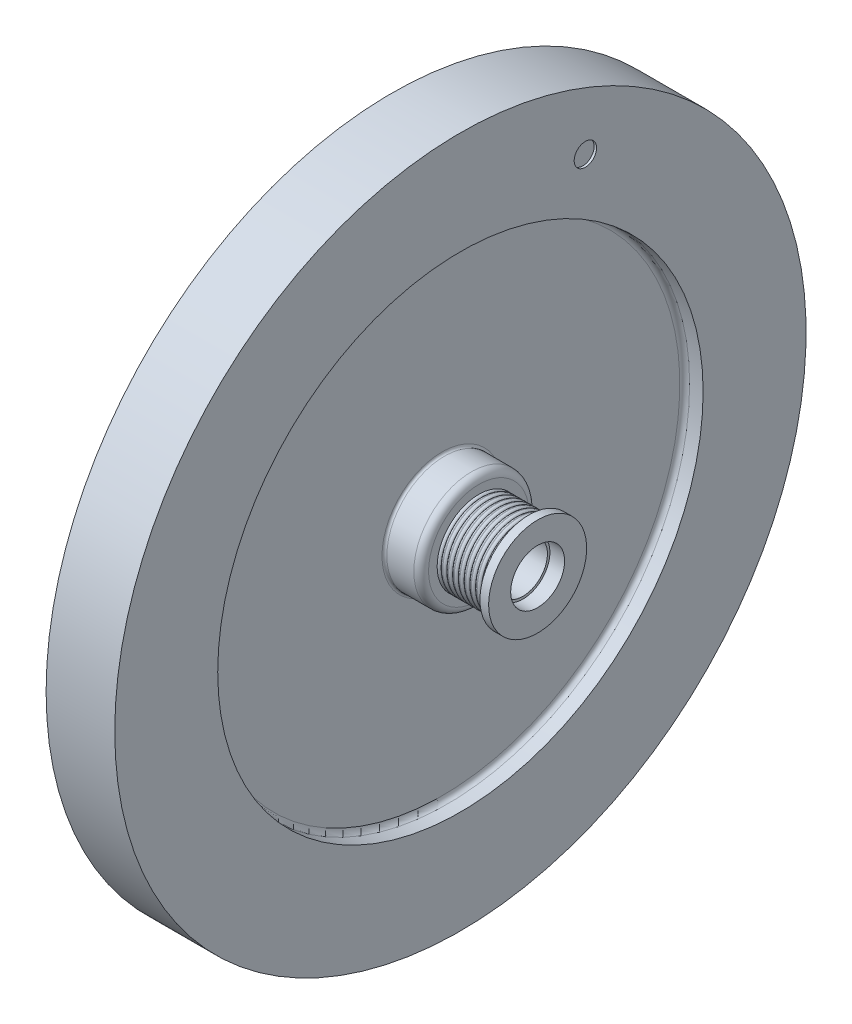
ISO-10303-21;
HEADER;
FILE_DESCRIPTION(('STEP AP214'),'2;1');
FILE_NAME('part.step','',(''),(''),'','','');
FILE_SCHEMA(('AUTOMOTIVE_DESIGN { 1 0 10303 214 1 1 1 1 }'));
ENDSEC;
DATA;
#1=APPLICATION_CONTEXT('core data for automotive mechanical design processes');
#2=APPLICATION_PROTOCOL_DEFINITION('international standard','automotive_design',2000,#1);
#3=PRODUCT_CONTEXT('',#1,'mechanical');
#4=PRODUCT('Part','Part','',(#3));
#5=PRODUCT_RELATED_PRODUCT_CATEGORY('part','',(#4));
#6=PRODUCT_DEFINITION_FORMATION('','',#4);
#7=PRODUCT_DEFINITION_CONTEXT('part definition',#1,'design');
#8=PRODUCT_DEFINITION('design','',#6,#7);
#9=PRODUCT_DEFINITION_SHAPE('','',#8);
#10=(LENGTH_UNIT() NAMED_UNIT(*) SI_UNIT(.MILLI.,.METRE.));
#11=(NAMED_UNIT(*) PLANE_ANGLE_UNIT() SI_UNIT($,.RADIAN.));
#12=(NAMED_UNIT(*) SI_UNIT($,.STERADIAN.) SOLID_ANGLE_UNIT());
#13=UNCERTAINTY_MEASURE_WITH_UNIT(LENGTH_MEASURE(1.E-05),#10,'distance_accuracy_value','');
#14=(GEOMETRIC_REPRESENTATION_CONTEXT(3) GLOBAL_UNCERTAINTY_ASSIGNED_CONTEXT((#13)) GLOBAL_UNIT_ASSIGNED_CONTEXT((#10,
#11,#12)) REPRESENTATION_CONTEXT('',''));
#15=CARTESIAN_POINT('',(0.,0.,0.));
#16=DIRECTION('',(0.,0.,1.));
#17=DIRECTION('',(1.,0.,0.));
#18=AXIS2_PLACEMENT_3D('',#15,#16,#17);
#19=CARTESIAN_POINT('',(454.339584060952,237.333609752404,0.));
#20=DIRECTION('',(-1.,0.,0.));
#21=DIRECTION('',(0.,0.,1.));
#22=AXIS2_PLACEMENT_3D('',#19,#20,#21);
#23=TOROIDAL_SURFACE('',#22,20.5,3.);
#24=CARTESIAN_POINT('',(454.339584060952,237.333609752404,0.));
#25=DIRECTION('',(-1.,0.,0.));
#26=DIRECTION('',(0.,0.,1.));
#27=AXIS2_PLACEMENT_3D('',#24,#25,#26);
#28=CIRCLE('',#27,23.5);
#29=CARTESIAN_POINT('',(454.339584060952,237.333609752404,23.5));
#30=VERTEX_POINT('',#29);
#31=EDGE_CURVE('E11',#30,#30,#28,.T.);
#32=ORIENTED_EDGE('',*,*,#31,.T.);
#33=EDGE_LOOP('',(#32));
#34=FACE_BOUND('',#33,.T.);
#35=CARTESIAN_POINT('',(451.339584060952,237.333609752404,0.));
#36=DIRECTION('',(-1.,0.,0.));
#37=DIRECTION('',(0.,0.,1.));
#38=AXIS2_PLACEMENT_3D('',#35,#36,#37);
#39=CIRCLE('',#38,20.5);
#40=CARTESIAN_POINT('',(451.339584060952,237.333609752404,20.5));
#41=VERTEX_POINT('',#40);
#42=EDGE_CURVE('E203',#41,#41,#39,.T.);
#43=ORIENTED_EDGE('',*,*,#42,.F.);
#44=EDGE_LOOP('',(#43));
#45=FACE_BOUND('',#44,.T.);
#46=ADVANCED_FACE('F43',(#34,#45),#23,.T.);
#47=CARTESIAN_POINT('',(437.512326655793,237.333609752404,0.));
#48=DIRECTION('',(-1.,0.,0.));
#49=DIRECTION('',(0.,0.,1.));
#50=AXIS2_PLACEMENT_3D('',#47,#48,#49);
#51=CYLINDRICAL_SURFACE('',#50,23.5);
#52=ORIENTED_EDGE('',*,*,#31,.F.);
#53=EDGE_LOOP('',(#52));
#54=FACE_BOUND('',#53,.T.);
#55=CARTESIAN_POINT('',(470.839584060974,237.333609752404,0.));
#56=DIRECTION('',(-1.,0.,0.));
#57=DIRECTION('',(0.,0.,1.));
#58=AXIS2_PLACEMENT_3D('',#55,#56,#57);
#59=CIRCLE('',#58,23.5);
#60=CARTESIAN_POINT('',(470.839584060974,237.333609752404,23.5));
#61=VERTEX_POINT('',#60);
#62=EDGE_CURVE('E49',#61,#61,#59,.T.);
#63=ORIENTED_EDGE('',*,*,#62,.T.);
#64=EDGE_LOOP('',(#63));
#65=FACE_BOUND('',#64,.T.);
#66=ADVANCED_FACE('F473',(#54,#65),#51,.T.);
#67=CARTESIAN_POINT('',(470.839584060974,237.333609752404,0.));
#68=DIRECTION('',(-1.,0.,0.));
#69=DIRECTION('',(0.,0.,1.));
#70=AXIS2_PLACEMENT_3D('',#67,#68,#69);
#71=TOROIDAL_SURFACE('',#70,24.5,1.);
#72=ORIENTED_EDGE('',*,*,#62,.F.);
#73=EDGE_LOOP('',(#72));
#74=FACE_BOUND('',#73,.T.);
#75=CARTESIAN_POINT('',(471.839584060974,237.333609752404,0.));
#76=DIRECTION('',(-1.,0.,0.));
#77=DIRECTION('',(0.,0.,1.));
#78=AXIS2_PLACEMENT_3D('',#75,#76,#77);
#79=CIRCLE('',#78,24.4999999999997);
#80=CARTESIAN_POINT('',(471.839584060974,237.333609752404,24.4999999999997));
#81=VERTEX_POINT('',#80);
#82=EDGE_CURVE('E53',#81,#81,#79,.T.);
#83=ORIENTED_EDGE('',*,*,#82,.T.);
#84=EDGE_LOOP('',(#83));
#85=FACE_BOUND('',#84,.T.);
#86=ADVANCED_FACE('F477',(#74,#85),#71,.F.);
#87=CARTESIAN_POINT('',(471.839584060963,312.833609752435,0.));
#88=DIRECTION('',(1.,0.,0.));
#89=DIRECTION('',(0.,0.,-1.));
#90=AXIS2_PLACEMENT_3D('',#87,#88,#89);
#91=PLANE('',#90);
#92=ORIENTED_EDGE('',*,*,#82,.F.);
#93=EDGE_LOOP('',(#92));
#94=FACE_BOUND('',#93,.T.);
#95=CARTESIAN_POINT('',(471.839584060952,237.333609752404,0.));
#96=DIRECTION('',(-1.,0.,0.));
#97=DIRECTION('',(0.,0.,1.));
#98=AXIS2_PLACEMENT_3D('',#95,#96,#97);
#99=CIRCLE('',#98,96.9999999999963);
#100=CARTESIAN_POINT('',(471.839584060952,237.333609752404,96.9999999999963));
#101=VERTEX_POINT('',#100);
#102=EDGE_CURVE('E57',#101,#101,#99,.T.);
#103=ORIENTED_EDGE('',*,*,#102,.T.);
#104=EDGE_LOOP('',(#103));
#105=FACE_BOUND('',#104,.T.);
#106=ADVANCED_FACE('F1457',(#94,#105),#91,.F.);
#107=CARTESIAN_POINT('',(469.839584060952,237.333609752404,0.));
#108=DIRECTION('',(-1.,0.,0.));
#109=DIRECTION('',(0.,0.,1.));
#110=AXIS2_PLACEMENT_3D('',#107,#108,#109);
#111=TOROIDAL_SURFACE('',#110,96.9999999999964,2.);
#112=ORIENTED_EDGE('',*,*,#102,.F.);
#113=EDGE_LOOP('',(#112));
#114=FACE_BOUND('',#113,.T.);
#115=CARTESIAN_POINT('',(469.839584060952,237.333609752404,0.));
#116=DIRECTION('',(-1.,0.,0.));
#117=DIRECTION('',(0.,0.,1.));
#118=AXIS2_PLACEMENT_3D('',#115,#116,#117);
#119=CIRCLE('',#118,98.9999999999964);
#120=CARTESIAN_POINT('',(469.839584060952,237.333609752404,98.9999999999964));
#121=VERTEX_POINT('',#120);
#122=EDGE_CURVE('E62',#121,#121,#119,.T.);
#123=ORIENTED_EDGE('',*,*,#122,.T.);
#124=EDGE_LOOP('',(#123));
#125=FACE_BOUND('',#124,.T.);
#126=ADVANCED_FACE('F1467',(#114,#125),#111,.F.);
#127=CARTESIAN_POINT('',(437.512326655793,237.333609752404,0.));
#128=DIRECTION('',(-1.,0.,0.));
#129=DIRECTION('',(0.,0.,1.));
#130=AXIS2_PLACEMENT_3D('',#127,#128,#129);
#131=CYLINDRICAL_SURFACE('',#130,98.9999999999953);
#132=CARTESIAN_POINT('',(463.339584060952,237.333609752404,0.));
#133=DIRECTION('',(-1.,0.,0.));
#134=DIRECTION('',(0.,0.,1.));
#135=AXIS2_PLACEMENT_3D('',#132,#133,#134);
#136=CIRCLE('',#135,98.9999999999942);
#137=CARTESIAN_POINT('',(463.339584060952,237.333609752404,98.9999999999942));
#138=VERTEX_POINT('',#137);
#139=EDGE_CURVE('E65',#138,#138,#136,.T.);
#140=ORIENTED_EDGE('',*,*,#139,.T.);
#141=EDGE_LOOP('',(#140));
#142=FACE_BOUND('',#141,.T.);
#143=ORIENTED_EDGE('',*,*,#122,.F.);
#144=EDGE_LOOP('',(#143));
#145=FACE_BOUND('',#144,.T.);
#146=ADVANCED_FACE('F1477',(#142,#145),#131,.F.);
#147=CARTESIAN_POINT('',(463.339584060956,312.833609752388,0.));
#148=DIRECTION('',(-1.,0.,0.));
#149=DIRECTION('',(0.,0.,1.));
#150=AXIS2_PLACEMENT_3D('',#147,#148,#149);
#151=PLANE('',#150);
#152=CARTESIAN_POINT('',(463.339584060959,237.333609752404,0.));
#153=DIRECTION('',(-1.,0.,0.));
#154=DIRECTION('',(0.,0.,1.));
#155=AXIS2_PLACEMENT_3D('',#152,#153,#154);
#156=CIRCLE('',#155,141.);
#157=CARTESIAN_POINT('',(463.339584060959,237.333609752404,141.));
#158=VERTEX_POINT('',#157);
#159=EDGE_CURVE('E68',#158,#158,#156,.T.);
#160=ORIENTED_EDGE('',*,*,#159,.T.);
#161=EDGE_LOOP('',(#160));
#162=FACE_BOUND('',#161,.T.);
#163=ORIENTED_EDGE('',*,*,#139,.F.);
#164=EDGE_LOOP('',(#163));
#165=FACE_BOUND('',#164,.T.);
#166=ADVANCED_FACE('F1487',(#162,#165),#151,.T.);
#167=CARTESIAN_POINT('',(437.512326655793,237.333609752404,0.));
#168=DIRECTION('',(-1.,0.,0.));
#169=DIRECTION('',(0.,0.,1.));
#170=AXIS2_PLACEMENT_3D('',#167,#168,#169);
#171=CYLINDRICAL_SURFACE('',#170,141.);
#172=ORIENTED_EDGE('',*,*,#159,.F.);
#173=EDGE_LOOP('',(#172));
#174=FACE_BOUND('',#173,.T.);
#175=CARTESIAN_POINT('',(491.339584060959,237.333609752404,0.));
#176=DIRECTION('',(-1.,0.,0.));
#177=DIRECTION('',(0.,0.,1.));
#178=AXIS2_PLACEMENT_3D('',#175,#176,#177);
#179=CIRCLE('',#178,141.000000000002);
#180=CARTESIAN_POINT('',(491.339584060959,237.333609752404,141.000000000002));
#181=VERTEX_POINT('',#180);
#182=EDGE_CURVE('E71',#181,#181,#179,.T.);
#183=ORIENTED_EDGE('',*,*,#182,.T.);
#184=EDGE_LOOP('',(#183));
#185=FACE_BOUND('',#184,.T.);
#186=ADVANCED_FACE('F456',(#174,#185),#171,.T.);
#187=CARTESIAN_POINT('',(491.339584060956,312.833609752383,0.));
#188=DIRECTION('',(-1.,0.,0.));
#189=DIRECTION('',(0.,0.,1.));
#190=AXIS2_PLACEMENT_3D('',#187,#188,#189);
#191=PLANE('',#190);
#192=CARTESIAN_POINT('',(491.339584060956,345.217536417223,-50.956202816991));
#193=DIRECTION('',(1.,0.,0.));
#194=DIRECTION('',(0.,0.,-1.));
#195=AXIS2_PLACEMENT_3D('',#192,#193,#194);
#196=CIRCLE('',#195,4.56481525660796);
#197=CARTESIAN_POINT('',(491.339584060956,345.217536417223,-55.5210180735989));
#198=VERTEX_POINT('',#197);
#199=EDGE_CURVE('E435',#198,#198,#196,.T.);
#200=ORIENTED_EDGE('',*,*,#199,.F.);
#201=EDGE_LOOP('',(#200));
#202=FACE_BOUND('',#201,.T.);
#203=ORIENTED_EDGE('',*,*,#182,.F.);
#204=EDGE_LOOP('',(#203));
#205=FACE_BOUND('',#204,.T.);
#206=CARTESIAN_POINT('',(491.339584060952,237.333609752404,0.));
#207=DIRECTION('',(-1.,0.,0.));
#208=DIRECTION('',(0.,0.,1.));
#209=AXIS2_PLACEMENT_3D('',#206,#207,#208);
#210=CIRCLE('',#209,98.9999999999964);
#211=CARTESIAN_POINT('',(491.339584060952,237.333609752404,98.9999999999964));
#212=VERTEX_POINT('',#211);
#213=EDGE_CURVE('E74',#212,#212,#210,.T.);
#214=ORIENTED_EDGE('',*,*,#213,.T.);
#215=EDGE_LOOP('',(#214));
#216=FACE_BOUND('',#215,.T.);
#217=ADVANCED_FACE('F452',(#202,#205,#216),#191,.F.);
#218=CARTESIAN_POINT('',(437.512326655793,237.333609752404,0.));
#219=DIRECTION('',(-1.,0.,0.));
#220=DIRECTION('',(0.,0.,1.));
#221=AXIS2_PLACEMENT_3D('',#218,#219,#220);
#222=CYLINDRICAL_SURFACE('',#221,98.9999999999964);
#223=CARTESIAN_POINT('',(485.839584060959,237.333609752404,0.));
#224=DIRECTION('',(-1.,0.,0.));
#225=DIRECTION('',(0.,0.,1.));
#226=AXIS2_PLACEMENT_3D('',#223,#224,#225);
#227=CIRCLE('',#226,98.9999999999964);
#228=CARTESIAN_POINT('',(485.839584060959,237.333609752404,98.9999999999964));
#229=VERTEX_POINT('',#228);
#230=EDGE_CURVE('E77',#229,#229,#227,.T.);
#231=ORIENTED_EDGE('',*,*,#230,.T.);
#232=EDGE_LOOP('',(#231));
#233=FACE_BOUND('',#232,.T.);
#234=ORIENTED_EDGE('',*,*,#213,.F.);
#235=EDGE_LOOP('',(#234));
#236=FACE_BOUND('',#235,.T.);
#237=ADVANCED_FACE('F455',(#233,#236),#222,.F.);
#238=CARTESIAN_POINT('',(485.839584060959,237.333609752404,0.));
#239=DIRECTION('',(-1.,0.,0.));
#240=DIRECTION('',(0.,0.,1.));
#241=AXIS2_PLACEMENT_3D('',#238,#239,#240);
#242=TOROIDAL_SURFACE('',#241,96.9999999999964,2.);
#243=ORIENTED_EDGE('',*,*,#230,.F.);
#244=EDGE_LOOP('',(#243));
#245=FACE_BOUND('',#244,.T.);
#246=CARTESIAN_POINT('',(483.839584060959,237.333609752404,0.));
#247=DIRECTION('',(-1.,0.,0.));
#248=DIRECTION('',(0.,0.,1.));
#249=AXIS2_PLACEMENT_3D('',#246,#247,#248);
#250=CIRCLE('',#249,96.9999999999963);
#251=CARTESIAN_POINT('',(483.839584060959,237.333609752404,96.9999999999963));
#252=VERTEX_POINT('',#251);
#253=EDGE_CURVE('E80',#252,#252,#250,.T.);
#254=ORIENTED_EDGE('',*,*,#253,.T.);
#255=EDGE_LOOP('',(#254));
#256=FACE_BOUND('',#255,.T.);
#257=ADVANCED_FACE('F463',(#245,#256),#242,.F.);
#258=CARTESIAN_POINT('',(483.839584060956,312.833609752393,0.));
#259=DIRECTION('',(1.,0.,0.));
#260=DIRECTION('',(0.,0.,-1.));
#261=AXIS2_PLACEMENT_3D('',#258,#259,#260);
#262=PLANE('',#261);
#263=CARTESIAN_POINT('',(483.839584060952,237.333609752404,0.));
#264=DIRECTION('',(-1.,0.,0.));
#265=DIRECTION('',(0.,0.,1.));
#266=AXIS2_PLACEMENT_3D('',#263,#264,#265);
#267=CIRCLE('',#266,24.4999999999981);
#268=CARTESIAN_POINT('',(483.839584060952,237.333609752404,24.4999999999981));
#269=VERTEX_POINT('',#268);
#270=EDGE_CURVE('E83',#269,#269,#267,.T.);
#271=ORIENTED_EDGE('',*,*,#270,.T.);
#272=EDGE_LOOP('',(#271));
#273=FACE_BOUND('',#272,.T.);
#274=ORIENTED_EDGE('',*,*,#253,.F.);
#275=EDGE_LOOP('',(#274));
#276=FACE_BOUND('',#275,.T.);
#277=ADVANCED_FACE('F469',(#273,#276),#262,.T.);
#278=CARTESIAN_POINT('',(484.839584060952,237.333609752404,0.));
#279=DIRECTION('',(-1.,0.,0.));
#280=DIRECTION('',(0.,0.,1.));
#281=AXIS2_PLACEMENT_3D('',#278,#279,#280);
#282=TOROIDAL_SURFACE('',#281,24.4999999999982,1.);
#283=ORIENTED_EDGE('',*,*,#270,.F.);
#284=EDGE_LOOP('',(#283));
#285=FACE_BOUND('',#284,.T.);
#286=CARTESIAN_POINT('',(484.839584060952,237.333609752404,0.));
#287=DIRECTION('',(-1.,0.,0.));
#288=DIRECTION('',(0.,0.,1.));
#289=AXIS2_PLACEMENT_3D('',#286,#287,#288);
#290=CIRCLE('',#289,23.4999999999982);
#291=CARTESIAN_POINT('',(484.839584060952,237.333609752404,23.4999999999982));
#292=VERTEX_POINT('',#291);
#293=EDGE_CURVE('E86',#292,#292,#290,.T.);
#294=ORIENTED_EDGE('',*,*,#293,.T.);
#295=EDGE_LOOP('',(#294));
#296=FACE_BOUND('',#295,.T.);
#297=ADVANCED_FACE('F635',(#285,#296),#282,.F.);
#298=CARTESIAN_POINT('',(437.512326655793,237.333609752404,0.));
#299=DIRECTION('',(-1.,0.,0.));
#300=DIRECTION('',(0.,0.,1.));
#301=AXIS2_PLACEMENT_3D('',#298,#299,#300);
#302=CYLINDRICAL_SURFACE('',#301,23.4999999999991);
#303=ORIENTED_EDGE('',*,*,#293,.F.);
#304=EDGE_LOOP('',(#303));
#305=FACE_BOUND('',#304,.T.);
#306=CARTESIAN_POINT('',(495.839584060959,237.333609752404,0.));
#307=DIRECTION('',(-1.,0.,0.));
#308=DIRECTION('',(0.,0.,1.));
#309=AXIS2_PLACEMENT_3D('',#306,#307,#308);
#310=CIRCLE('',#309,23.5);
#311=CARTESIAN_POINT('',(495.839584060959,237.333609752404,23.5));
#312=VERTEX_POINT('',#311);
#313=EDGE_CURVE('E89',#312,#312,#310,.T.);
#314=ORIENTED_EDGE('',*,*,#313,.T.);
#315=EDGE_LOOP('',(#314));
#316=FACE_BOUND('',#315,.T.);
#317=ADVANCED_FACE('F631',(#305,#316),#302,.T.);
#318=CARTESIAN_POINT('',(495.839584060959,237.333609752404,0.));
#319=DIRECTION('',(-1.,0.,0.));
#320=DIRECTION('',(0.,0.,1.));
#321=AXIS2_PLACEMENT_3D('',#318,#319,#320);
#322=TOROIDAL_SURFACE('',#321,20.5,3.);
#323=CARTESIAN_POINT('',(498.839584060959,237.333609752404,0.));
#324=DIRECTION('',(-1.,0.,0.));
#325=DIRECTION('',(0.,0.,1.));
#326=AXIS2_PLACEMENT_3D('',#323,#324,#325);
#327=CIRCLE('',#326,20.4999999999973);
#328=CARTESIAN_POINT('',(498.839584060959,237.333609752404,20.4999999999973));
#329=VERTEX_POINT('',#328);
#330=EDGE_CURVE('E92',#329,#329,#327,.T.);
#331=ORIENTED_EDGE('',*,*,#330,.T.);
#332=EDGE_LOOP('',(#331));
#333=FACE_BOUND('',#332,.T.);
#334=ORIENTED_EDGE('',*,*,#313,.F.);
#335=EDGE_LOOP('',(#334));
#336=FACE_BOUND('',#335,.T.);
#337=ADVANCED_FACE('F627',(#333,#336),#322,.T.);
#338=CARTESIAN_POINT('',(498.839584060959,312.833609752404,0.));
#339=DIRECTION('',(1.,0.,0.));
#340=DIRECTION('',(0.,0.,-1.));
#341=AXIS2_PLACEMENT_3D('',#338,#339,#340);
#342=PLANE('',#341);
#343=CARTESIAN_POINT('',(498.839584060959,237.333609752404,0.));
#344=DIRECTION('',(-1.,0.,0.));
#345=DIRECTION('',(0.,0.,1.));
#346=AXIS2_PLACEMENT_3D('',#343,#344,#345);
#347=CIRCLE('',#346,16.9996112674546);
#348=CARTESIAN_POINT('',(498.839584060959,237.333609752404,16.9996112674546));
#349=VERTEX_POINT('',#348);
#350=EDGE_CURVE('E95',#349,#349,#347,.T.);
#351=ORIENTED_EDGE('',*,*,#350,.T.);
#352=EDGE_LOOP('',(#351));
#353=FACE_BOUND('',#352,.T.);
#354=ORIENTED_EDGE('',*,*,#330,.F.);
#355=EDGE_LOOP('',(#354));
#356=FACE_BOUND('',#355,.T.);
#357=ADVANCED_FACE('F623',(#353,#356),#342,.T.);
#358=CARTESIAN_POINT('',(498.809042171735,237.333609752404,0.));
#359=DIRECTION('',(-1.,0.,0.));
#360=DIRECTION('',(0.,0.,1.));
#361=AXIS2_PLACEMENT_3D('',#358,#359,#360);
#362=TOROIDAL_SURFACE('',#361,15.7999999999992,1.20000000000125);
#363=CARTESIAN_POINT('',(499.884313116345,237.333609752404,0.));
#364=DIRECTION('',(-1.,0.,0.));
#365=DIRECTION('',(0.,0.,1.));
#366=AXIS2_PLACEMENT_3D('',#363,#364,#365);
#367=CIRCLE('',#366,16.3327216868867);
#368=CARTESIAN_POINT('',(499.884313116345,237.333609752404,16.3327216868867));
#369=VERTEX_POINT('',#368);
#370=EDGE_CURVE('E98',#369,#369,#367,.T.);
#371=ORIENTED_EDGE('',*,*,#370,.T.);
#372=EDGE_LOOP('',(#371));
#373=FACE_BOUND('',#372,.T.);
#374=ORIENTED_EDGE('',*,*,#350,.F.);
#375=EDGE_LOOP('',(#374));
#376=FACE_BOUND('',#375,.T.);
#377=ADVANCED_FACE('F619',(#373,#376),#362,.T.);
#378=CARTESIAN_POINT('',(500.959584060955,237.333609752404,0.));
#379=DIRECTION('',(-1.,0.,0.));
#380=DIRECTION('',(0.,0.,1.));
#381=AXIS2_PLACEMENT_3D('',#378,#379,#380);
#382=TOROIDAL_SURFACE('',#381,15.7999999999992,1.20000000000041);
#383=CARTESIAN_POINT('',(500.959584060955,237.333609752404,0.));
#384=DIRECTION('',(-1.,0.,0.));
#385=DIRECTION('',(0.,0.,1.));
#386=AXIS2_PLACEMENT_3D('',#383,#384,#385);
#387=CIRCLE('',#386,16.9999999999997);
#388=CARTESIAN_POINT('',(500.959584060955,237.333609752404,16.9999999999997));
#389=VERTEX_POINT('',#388);
#390=EDGE_CURVE('E101',#389,#389,#387,.T.);
#391=ORIENTED_EDGE('',*,*,#390,.T.);
#392=EDGE_LOOP('',(#391));
#393=FACE_BOUND('',#392,.T.);
#394=ORIENTED_EDGE('',*,*,#370,.F.);
#395=EDGE_LOOP('',(#394));
#396=FACE_BOUND('',#395,.T.);
#397=ADVANCED_FACE('F615',(#393,#396),#382,.T.);
#398=CARTESIAN_POINT('',(437.512326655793,237.333609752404,0.));
#399=DIRECTION('',(-1.,0.,0.));
#400=DIRECTION('',(0.,0.,1.));
#401=AXIS2_PLACEMENT_3D('',#398,#399,#400);
#402=CYLINDRICAL_SURFACE('',#401,16.9999999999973);
#403=ORIENTED_EDGE('',*,*,#390,.F.);
#404=EDGE_LOOP('',(#403));
#405=FACE_BOUND('',#404,.T.);
#406=CARTESIAN_POINT('',(501.149042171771,237.333609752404,0.));
#407=DIRECTION('',(-1.,0.,0.));
#408=DIRECTION('',(0.,0.,1.));
#409=AXIS2_PLACEMENT_3D('',#406,#407,#408);
#410=CIRCLE('',#409,16.999999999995);
#411=CARTESIAN_POINT('',(501.149042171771,237.333609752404,16.999999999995));
#412=VERTEX_POINT('',#411);
#413=EDGE_CURVE('E104',#412,#412,#410,.T.);
#414=ORIENTED_EDGE('',*,*,#413,.T.);
#415=EDGE_LOOP('',(#414));
#416=FACE_BOUND('',#415,.T.);
#417=ADVANCED_FACE('F611',(#405,#416),#402,.T.);
#418=CARTESIAN_POINT('',(501.149042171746,237.333609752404,0.));
#419=DIRECTION('',(-1.,0.,0.));
#420=DIRECTION('',(0.,0.,1.));
#421=AXIS2_PLACEMENT_3D('',#418,#419,#420);
#422=TOROIDAL_SURFACE('',#421,15.7999999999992,1.19999999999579);
#423=CARTESIAN_POINT('',(502.224313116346,237.333609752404,0.));
#424=DIRECTION('',(-1.,0.,0.));
#425=DIRECTION('',(0.,0.,1.));
#426=AXIS2_PLACEMENT_3D('',#423,#424,#425);
#427=CIRCLE('',#426,16.3327216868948);
#428=CARTESIAN_POINT('',(502.224313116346,237.333609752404,16.3327216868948));
#429=VERTEX_POINT('',#428);
#430=EDGE_CURVE('E107',#429,#429,#427,.T.);
#431=ORIENTED_EDGE('',*,*,#430,.T.);
#432=EDGE_LOOP('',(#431));
#433=FACE_BOUND('',#432,.T.);
#434=ORIENTED_EDGE('',*,*,#413,.F.);
#435=EDGE_LOOP('',(#434));
#436=FACE_BOUND('',#435,.T.);
#437=ADVANCED_FACE('F607',(#433,#436),#422,.T.);
#438=CARTESIAN_POINT('',(503.299584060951,237.333609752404,0.));
#439=DIRECTION('',(-1.,0.,0.));
#440=DIRECTION('',(0.,0.,1.));
#441=AXIS2_PLACEMENT_3D('',#438,#439,#440);
#442=TOROIDAL_SURFACE('',#441,15.7999999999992,1.19999999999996);
#443=CARTESIAN_POINT('',(503.299584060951,237.333609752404,0.));
#444=DIRECTION('',(-1.,0.,0.));
#445=DIRECTION('',(0.,0.,1.));
#446=AXIS2_PLACEMENT_3D('',#443,#444,#445);
#447=CIRCLE('',#446,16.9999999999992);
#448=CARTESIAN_POINT('',(503.299584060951,237.333609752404,16.9999999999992));
#449=VERTEX_POINT('',#448);
#450=EDGE_CURVE('E110',#449,#449,#447,.T.);
#451=ORIENTED_EDGE('',*,*,#450,.T.);
#452=EDGE_LOOP('',(#451));
#453=FACE_BOUND('',#452,.T.);
#454=ORIENTED_EDGE('',*,*,#430,.F.);
#455=EDGE_LOOP('',(#454));
#456=FACE_BOUND('',#455,.T.);
#457=ADVANCED_FACE('F603',(#453,#456),#442,.T.);
#458=CARTESIAN_POINT('',(437.512326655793,237.333609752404,0.));
#459=DIRECTION('',(-1.,0.,0.));
#460=DIRECTION('',(0.,0.,1.));
#461=AXIS2_PLACEMENT_3D('',#458,#459,#460);
#462=CYLINDRICAL_SURFACE('',#461,16.9999999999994);
#463=ORIENTED_EDGE('',*,*,#450,.F.);
#464=EDGE_LOOP('',(#463));
#465=FACE_BOUND('',#464,.T.);
#466=CARTESIAN_POINT('',(503.48904217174,237.333609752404,0.));
#467=DIRECTION('',(-1.,0.,0.));
#468=DIRECTION('',(0.,0.,1.));
#469=AXIS2_PLACEMENT_3D('',#466,#467,#468);
#470=CIRCLE('',#469,16.9999999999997);
#471=CARTESIAN_POINT('',(503.48904217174,237.333609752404,16.9999999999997));
#472=VERTEX_POINT('',#471);
#473=EDGE_CURVE('E113',#472,#472,#470,.T.);
#474=ORIENTED_EDGE('',*,*,#473,.T.);
#475=EDGE_LOOP('',(#474));
#476=FACE_BOUND('',#475,.T.);
#477=ADVANCED_FACE('F599',(#465,#476),#462,.T.);
#478=CARTESIAN_POINT('',(503.489042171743,237.333609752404,0.));
#479=DIRECTION('',(-1.,0.,0.));
#480=DIRECTION('',(0.,0.,1.));
#481=AXIS2_PLACEMENT_3D('',#478,#479,#480);
#482=TOROIDAL_SURFACE('',#481,15.7999999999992,1.20000000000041);
#483=CARTESIAN_POINT('',(504.564313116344,237.333609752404,0.));
#484=DIRECTION('',(-1.,0.,0.));
#485=DIRECTION('',(0.,0.,1.));
#486=AXIS2_PLACEMENT_3D('',#483,#484,#485);
#487=CIRCLE('',#486,16.3327216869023);
#488=CARTESIAN_POINT('',(504.564313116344,237.333609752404,16.3327216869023));
#489=VERTEX_POINT('',#488);
#490=EDGE_CURVE('E116',#489,#489,#487,.T.);
#491=ORIENTED_EDGE('',*,*,#490,.T.);
#492=EDGE_LOOP('',(#491));
#493=FACE_BOUND('',#492,.T.);
#494=ORIENTED_EDGE('',*,*,#473,.F.);
#495=EDGE_LOOP('',(#494));
#496=FACE_BOUND('',#495,.T.);
#497=ADVANCED_FACE('F595',(#493,#496),#482,.T.);
#498=CARTESIAN_POINT('',(505.639584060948,237.333609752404,0.));
#499=DIRECTION('',(-1.,0.,0.));
#500=DIRECTION('',(0.,0.,1.));
#501=AXIS2_PLACEMENT_3D('',#498,#499,#500);
#502=TOROIDAL_SURFACE('',#501,15.7999999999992,1.20000000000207);
#503=CARTESIAN_POINT('',(505.639584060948,237.333609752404,0.));
#504=DIRECTION('',(-1.,0.,0.));
#505=DIRECTION('',(0.,0.,1.));
#506=AXIS2_PLACEMENT_3D('',#503,#504,#505);
#507=CIRCLE('',#506,17.0000000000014);
#508=CARTESIAN_POINT('',(505.639584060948,237.333609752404,17.0000000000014));
#509=VERTEX_POINT('',#508);
#510=EDGE_CURVE('E119',#509,#509,#507,.T.);
#511=ORIENTED_EDGE('',*,*,#510,.T.);
#512=EDGE_LOOP('',(#511));
#513=FACE_BOUND('',#512,.T.);
#514=ORIENTED_EDGE('',*,*,#490,.F.);
#515=EDGE_LOOP('',(#514));
#516=FACE_BOUND('',#515,.T.);
#517=ADVANCED_FACE('F591',(#513,#516),#502,.T.);
#518=CARTESIAN_POINT('',(437.512326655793,237.333609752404,0.));
#519=DIRECTION('',(-1.,0.,0.));
#520=DIRECTION('',(0.,0.,1.));
#521=AXIS2_PLACEMENT_3D('',#518,#519,#520);
#522=CYLINDRICAL_SURFACE('',#521,17.);
#523=ORIENTED_EDGE('',*,*,#510,.F.);
#524=EDGE_LOOP('',(#523));
#525=FACE_BOUND('',#524,.T.);
#526=CARTESIAN_POINT('',(505.829042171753,237.333609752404,0.));
#527=DIRECTION('',(-1.,0.,0.));
#528=DIRECTION('',(0.,0.,1.));
#529=AXIS2_PLACEMENT_3D('',#526,#527,#528);
#530=CIRCLE('',#529,16.9999999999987);
#531=CARTESIAN_POINT('',(505.829042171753,237.333609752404,16.9999999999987));
#532=VERTEX_POINT('',#531);
#533=EDGE_CURVE('E122',#532,#532,#530,.T.);
#534=ORIENTED_EDGE('',*,*,#533,.T.);
#535=EDGE_LOOP('',(#534));
#536=FACE_BOUND('',#535,.T.);
#537=ADVANCED_FACE('F587',(#525,#536),#522,.T.);
#538=CARTESIAN_POINT('',(505.829042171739,237.333609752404,0.));
#539=DIRECTION('',(-1.,0.,0.));
#540=DIRECTION('',(0.,0.,1.));
#541=AXIS2_PLACEMENT_3D('',#538,#539,#540);
#542=TOROIDAL_SURFACE('',#541,15.7999999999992,1.19999999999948);
#543=CARTESIAN_POINT('',(506.904313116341,237.333609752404,0.));
#544=DIRECTION('',(-1.,0.,0.));
#545=DIRECTION('',(0.,0.,1.));
#546=AXIS2_PLACEMENT_3D('',#543,#544,#545);
#547=CIRCLE('',#546,16.332721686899);
#548=CARTESIAN_POINT('',(506.904313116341,237.333609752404,16.332721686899));
#549=VERTEX_POINT('',#548);
#550=EDGE_CURVE('E125',#549,#549,#547,.T.);
#551=ORIENTED_EDGE('',*,*,#550,.T.);
#552=EDGE_LOOP('',(#551));
#553=FACE_BOUND('',#552,.T.);
#554=ORIENTED_EDGE('',*,*,#533,.F.);
#555=EDGE_LOOP('',(#554));
#556=FACE_BOUND('',#555,.T.);
#557=ADVANCED_FACE('F583',(#553,#556),#542,.T.);
#558=CARTESIAN_POINT('',(507.979584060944,237.333609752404,0.));
#559=DIRECTION('',(-1.,0.,0.));
#560=DIRECTION('',(0.,0.,1.));
#561=AXIS2_PLACEMENT_3D('',#558,#559,#560);
#562=TOROIDAL_SURFACE('',#561,15.7999999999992,1.19999999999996);
#563=CARTESIAN_POINT('',(507.979584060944,237.333609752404,0.));
#564=DIRECTION('',(-1.,0.,0.));
#565=DIRECTION('',(0.,0.,1.));
#566=AXIS2_PLACEMENT_3D('',#563,#564,#565);
#567=CIRCLE('',#566,16.9999999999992);
#568=CARTESIAN_POINT('',(507.979584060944,237.333609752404,16.9999999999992));
#569=VERTEX_POINT('',#568);
#570=EDGE_CURVE('E128',#569,#569,#567,.T.);
#571=ORIENTED_EDGE('',*,*,#570,.T.);
#572=EDGE_LOOP('',(#571));
#573=FACE_BOUND('',#572,.T.);
#574=ORIENTED_EDGE('',*,*,#550,.F.);
#575=EDGE_LOOP('',(#574));
#576=FACE_BOUND('',#575,.T.);
#577=ADVANCED_FACE('F579',(#573,#576),#562,.T.);
#578=CARTESIAN_POINT('',(437.512326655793,237.333609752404,0.));
#579=DIRECTION('',(-1.,0.,0.));
#580=DIRECTION('',(0.,0.,1.));
#581=AXIS2_PLACEMENT_3D('',#578,#579,#580);
#582=CYLINDRICAL_SURFACE('',#581,16.9999999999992);
#583=ORIENTED_EDGE('',*,*,#570,.F.);
#584=EDGE_LOOP('',(#583));
#585=FACE_BOUND('',#584,.T.);
#586=CARTESIAN_POINT('',(508.169042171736,237.333609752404,0.));
#587=DIRECTION('',(-1.,0.,0.));
#588=DIRECTION('',(0.,0.,1.));
#589=AXIS2_PLACEMENT_3D('',#586,#587,#588);
#590=CIRCLE('',#589,16.9999999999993);
#591=CARTESIAN_POINT('',(508.169042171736,237.333609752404,16.9999999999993));
#592=VERTEX_POINT('',#591);
#593=EDGE_CURVE('E131',#592,#592,#590,.T.);
#594=ORIENTED_EDGE('',*,*,#593,.T.);
#595=EDGE_LOOP('',(#594));
#596=FACE_BOUND('',#595,.T.);
#597=ADVANCED_FACE('F575',(#585,#596),#582,.T.);
#598=CARTESIAN_POINT('',(508.169042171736,237.333609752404,0.));
#599=DIRECTION('',(-1.,0.,0.));
#600=DIRECTION('',(0.,0.,1.));
#601=AXIS2_PLACEMENT_3D('',#598,#599,#600);
#602=TOROIDAL_SURFACE('',#601,15.7999999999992,1.20000000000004);
#603=CARTESIAN_POINT('',(509.244313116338,237.333609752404,0.));
#604=DIRECTION('',(-1.,0.,0.));
#605=DIRECTION('',(0.,0.,1.));
#606=AXIS2_PLACEMENT_3D('',#603,#604,#605);
#607=CIRCLE('',#606,16.3327216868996);
#608=CARTESIAN_POINT('',(509.244313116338,237.333609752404,16.3327216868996));
#609=VERTEX_POINT('',#608);
#610=EDGE_CURVE('E134',#609,#609,#607,.T.);
#611=ORIENTED_EDGE('',*,*,#610,.T.);
#612=EDGE_LOOP('',(#611));
#613=FACE_BOUND('',#612,.T.);
#614=ORIENTED_EDGE('',*,*,#593,.F.);
#615=EDGE_LOOP('',(#614));
#616=FACE_BOUND('',#615,.T.);
#617=ADVANCED_FACE('F571',(#613,#616),#602,.T.);
#618=CARTESIAN_POINT('',(510.319584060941,237.333609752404,0.));
#619=DIRECTION('',(-1.,0.,0.));
#620=DIRECTION('',(0.,0.,1.));
#621=AXIS2_PLACEMENT_3D('',#618,#619,#620);
#622=TOROIDAL_SURFACE('',#621,15.7999999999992,1.20000000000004);
#623=CARTESIAN_POINT('',(510.319584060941,237.333609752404,0.));
#624=DIRECTION('',(-1.,0.,0.));
#625=DIRECTION('',(0.,0.,1.));
#626=AXIS2_PLACEMENT_3D('',#623,#624,#625);
#627=CIRCLE('',#626,16.9999999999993);
#628=CARTESIAN_POINT('',(510.319584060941,237.333609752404,16.9999999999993));
#629=VERTEX_POINT('',#628);
#630=EDGE_CURVE('E137',#629,#629,#627,.T.);
#631=ORIENTED_EDGE('',*,*,#630,.T.);
#632=EDGE_LOOP('',(#631));
#633=FACE_BOUND('',#632,.T.);
#634=ORIENTED_EDGE('',*,*,#610,.F.);
#635=EDGE_LOOP('',(#634));
#636=FACE_BOUND('',#635,.T.);
#637=ADVANCED_FACE('F567',(#633,#636),#622,.T.);
#638=CARTESIAN_POINT('',(437.512326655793,237.333609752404,0.));
#639=DIRECTION('',(-1.,0.,0.));
#640=DIRECTION('',(0.,0.,1.));
#641=AXIS2_PLACEMENT_3D('',#638,#639,#640);
#642=CYLINDRICAL_SURFACE('',#641,16.9999999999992);
#643=ORIENTED_EDGE('',*,*,#630,.F.);
#644=EDGE_LOOP('',(#643));
#645=FACE_BOUND('',#644,.T.);
#646=CARTESIAN_POINT('',(510.509042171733,237.333609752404,0.));
#647=DIRECTION('',(-1.,0.,0.));
#648=DIRECTION('',(0.,0.,1.));
#649=AXIS2_PLACEMENT_3D('',#646,#647,#648);
#650=CIRCLE('',#649,16.9999999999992);
#651=CARTESIAN_POINT('',(510.509042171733,237.333609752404,16.9999999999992));
#652=VERTEX_POINT('',#651);
#653=EDGE_CURVE('E140',#652,#652,#650,.T.);
#654=ORIENTED_EDGE('',*,*,#653,.T.);
#655=EDGE_LOOP('',(#654));
#656=FACE_BOUND('',#655,.T.);
#657=ADVANCED_FACE('F563',(#645,#656),#642,.T.);
#658=CARTESIAN_POINT('',(510.509042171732,237.333609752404,0.));
#659=DIRECTION('',(-1.,0.,0.));
#660=DIRECTION('',(0.,0.,1.));
#661=AXIS2_PLACEMENT_3D('',#658,#659,#660);
#662=TOROIDAL_SURFACE('',#661,15.7999999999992,1.19999999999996);
#663=CARTESIAN_POINT('',(511.584313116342,237.333609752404,0.));
#664=DIRECTION('',(-1.,0.,0.));
#665=DIRECTION('',(0.,0.,1.));
#666=AXIS2_PLACEMENT_3D('',#663,#664,#665);
#667=CIRCLE('',#666,16.3327216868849);
#668=CARTESIAN_POINT('',(511.584313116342,237.333609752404,16.3327216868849));
#669=VERTEX_POINT('',#668);
#670=EDGE_CURVE('E143',#669,#669,#667,.T.);
#671=ORIENTED_EDGE('',*,*,#670,.T.);
#672=EDGE_LOOP('',(#671));
#673=FACE_BOUND('',#672,.T.);
#674=ORIENTED_EDGE('',*,*,#653,.F.);
#675=EDGE_LOOP('',(#674));
#676=FACE_BOUND('',#675,.T.);
#677=ADVANCED_FACE('F559',(#673,#676),#662,.T.);
#678=CARTESIAN_POINT('',(512.659584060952,237.333609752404,0.));
#679=DIRECTION('',(-1.,0.,0.));
#680=DIRECTION('',(0.,0.,1.));
#681=AXIS2_PLACEMENT_3D('',#678,#679,#680);
#682=TOROIDAL_SURFACE('',#681,15.7999999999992,1.19999999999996);
#683=CARTESIAN_POINT('',(512.659584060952,237.333609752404,0.));
#684=DIRECTION('',(-1.,0.,0.));
#685=DIRECTION('',(0.,0.,1.));
#686=AXIS2_PLACEMENT_3D('',#683,#684,#685);
#687=CIRCLE('',#686,16.9999999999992);
#688=CARTESIAN_POINT('',(512.659584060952,237.333609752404,16.9999999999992));
#689=VERTEX_POINT('',#688);
#690=EDGE_CURVE('E146',#689,#689,#687,.T.);
#691=ORIENTED_EDGE('',*,*,#690,.T.);
#692=EDGE_LOOP('',(#691));
#693=FACE_BOUND('',#692,.T.);
#694=ORIENTED_EDGE('',*,*,#670,.F.);
#695=EDGE_LOOP('',(#694));
#696=FACE_BOUND('',#695,.T.);
#697=ADVANCED_FACE('F555',(#693,#696),#682,.T.);
#698=CARTESIAN_POINT('',(437.512326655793,237.333609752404,0.));
#699=DIRECTION('',(-1.,0.,0.));
#700=DIRECTION('',(0.,0.,1.));
#701=AXIS2_PLACEMENT_3D('',#698,#699,#700);
#702=CYLINDRICAL_SURFACE('',#701,16.9999999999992);
#703=ORIENTED_EDGE('',*,*,#690,.F.);
#704=EDGE_LOOP('',(#703));
#705=FACE_BOUND('',#704,.T.);
#706=CARTESIAN_POINT('',(512.849042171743,237.333609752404,0.));
#707=DIRECTION('',(-1.,0.,0.));
#708=DIRECTION('',(0.,0.,1.));
#709=AXIS2_PLACEMENT_3D('',#706,#707,#708);
#710=CIRCLE('',#709,16.9999999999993);
#711=CARTESIAN_POINT('',(512.849042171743,237.333609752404,16.9999999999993));
#712=VERTEX_POINT('',#711);
#713=EDGE_CURVE('E149',#712,#712,#710,.T.);
#714=ORIENTED_EDGE('',*,*,#713,.T.);
#715=EDGE_LOOP('',(#714));
#716=FACE_BOUND('',#715,.T.);
#717=ADVANCED_FACE('F551',(#705,#716),#702,.T.);
#718=CARTESIAN_POINT('',(512.849042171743,237.333609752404,0.));
#719=DIRECTION('',(-1.,0.,0.));
#720=DIRECTION('',(0.,0.,1.));
#721=AXIS2_PLACEMENT_3D('',#718,#719,#720);
#722=TOROIDAL_SURFACE('',#721,15.7999999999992,1.20000000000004);
#723=CARTESIAN_POINT('',(513.924313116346,237.333609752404,0.));
#724=DIRECTION('',(-1.,0.,0.));
#725=DIRECTION('',(0.,0.,1.));
#726=AXIS2_PLACEMENT_3D('',#723,#724,#725);
#727=CIRCLE('',#726,16.3327216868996);
#728=CARTESIAN_POINT('',(513.924313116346,237.333609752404,16.3327216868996));
#729=VERTEX_POINT('',#728);
#730=EDGE_CURVE('E152',#729,#729,#727,.T.);
#731=ORIENTED_EDGE('',*,*,#730,.T.);
#732=EDGE_LOOP('',(#731));
#733=FACE_BOUND('',#732,.T.);
#734=ORIENTED_EDGE('',*,*,#713,.F.);
#735=EDGE_LOOP('',(#734));
#736=FACE_BOUND('',#735,.T.);
#737=ADVANCED_FACE('F547',(#733,#736),#722,.T.);
#738=CARTESIAN_POINT('',(514.999584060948,237.333609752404,0.));
#739=DIRECTION('',(-1.,0.,0.));
#740=DIRECTION('',(0.,0.,1.));
#741=AXIS2_PLACEMENT_3D('',#738,#739,#740);
#742=TOROIDAL_SURFACE('',#741,15.7999999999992,1.20000000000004);
#743=CARTESIAN_POINT('',(514.999584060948,237.333609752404,0.));
#744=DIRECTION('',(-1.,0.,0.));
#745=DIRECTION('',(0.,0.,1.));
#746=AXIS2_PLACEMENT_3D('',#743,#744,#745);
#747=CIRCLE('',#746,16.9999999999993);
#748=CARTESIAN_POINT('',(514.999584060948,237.333609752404,16.9999999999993));
#749=VERTEX_POINT('',#748);
#750=EDGE_CURVE('E155',#749,#749,#747,.T.);
#751=ORIENTED_EDGE('',*,*,#750,.T.);
#752=EDGE_LOOP('',(#751));
#753=FACE_BOUND('',#752,.T.);
#754=ORIENTED_EDGE('',*,*,#730,.F.);
#755=EDGE_LOOP('',(#754));
#756=FACE_BOUND('',#755,.T.);
#757=ADVANCED_FACE('F543',(#753,#756),#742,.T.);
#758=CARTESIAN_POINT('',(437.512326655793,237.333609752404,0.));
#759=DIRECTION('',(-1.,0.,0.));
#760=DIRECTION('',(0.,0.,1.));
#761=AXIS2_PLACEMENT_3D('',#758,#759,#760);
#762=CYLINDRICAL_SURFACE('',#761,17.0000000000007);
#763=ORIENTED_EDGE('',*,*,#750,.F.);
#764=EDGE_LOOP('',(#763));
#765=FACE_BOUND('',#764,.T.);
#766=CARTESIAN_POINT('',(515.189042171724,237.333609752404,0.));
#767=DIRECTION('',(-1.,0.,0.));
#768=DIRECTION('',(0.,0.,1.));
#769=AXIS2_PLACEMENT_3D('',#766,#767,#768);
#770=CIRCLE('',#769,17.0000000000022);
#771=CARTESIAN_POINT('',(515.189042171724,237.333609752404,17.0000000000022));
#772=VERTEX_POINT('',#771);
#773=EDGE_CURVE('E158',#772,#772,#770,.T.);
#774=ORIENTED_EDGE('',*,*,#773,.T.);
#775=EDGE_LOOP('',(#774));
#776=FACE_BOUND('',#775,.T.);
#777=ADVANCED_FACE('F539',(#765,#776),#762,.T.);
#778=CARTESIAN_POINT('',(515.18904217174,237.333609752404,0.));
#779=DIRECTION('',(-1.,0.,0.));
#780=DIRECTION('',(0.,0.,1.));
#781=AXIS2_PLACEMENT_3D('',#778,#779,#780);
#782=TOROIDAL_SURFACE('',#781,15.7999999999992,1.20000000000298);
#783=CARTESIAN_POINT('',(516.26431311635,237.333609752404,0.));
#784=DIRECTION('',(-1.,0.,0.));
#785=DIRECTION('',(0.,0.,1.));
#786=AXIS2_PLACEMENT_3D('',#783,#784,#785);
#787=CIRCLE('',#786,16.3327216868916);
#788=CARTESIAN_POINT('',(516.26431311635,237.333609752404,16.3327216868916));
#789=VERTEX_POINT('',#788);
#790=EDGE_CURVE('E161',#789,#789,#787,.T.);
#791=ORIENTED_EDGE('',*,*,#790,.T.);
#792=EDGE_LOOP('',(#791));
#793=FACE_BOUND('',#792,.T.);
#794=ORIENTED_EDGE('',*,*,#773,.F.);
#795=EDGE_LOOP('',(#794));
#796=FACE_BOUND('',#795,.T.);
#797=ADVANCED_FACE('F535',(#793,#796),#782,.T.);
#798=CARTESIAN_POINT('',(517.339584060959,237.333609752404,0.));
#799=DIRECTION('',(-1.,0.,0.));
#800=DIRECTION('',(0.,0.,1.));
#801=AXIS2_PLACEMENT_3D('',#798,#799,#800);
#802=TOROIDAL_SURFACE('',#801,15.7999999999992,1.20000000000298);
#803=CARTESIAN_POINT('',(517.304049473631,237.333609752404,0.));
#804=DIRECTION('',(-1.,0.,0.));
#805=DIRECTION('',(0.,0.,1.));
#806=AXIS2_PLACEMENT_3D('',#803,#804,#805);
#807=CIRCLE('',#806,16.9994737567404);
#808=CARTESIAN_POINT('',(517.304049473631,237.333609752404,16.9994737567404));
#809=VERTEX_POINT('',#808);
#810=EDGE_CURVE('E164',#809,#809,#807,.T.);
#811=ORIENTED_EDGE('',*,*,#810,.T.);
#812=EDGE_LOOP('',(#811));
#813=FACE_BOUND('',#812,.T.);
#814=ORIENTED_EDGE('',*,*,#790,.F.);
#815=EDGE_LOOP('',(#814));
#816=FACE_BOUND('',#815,.T.);
#817=ADVANCED_FACE('F531',(#813,#816),#802,.T.);
#818=CARTESIAN_POINT('',(519.304400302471,237.333609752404,0.));
#819=DIRECTION('',(1.,0.,0.));
#820=DIRECTION('',(0.,0.,-1.));
#821=AXIS2_PLACEMENT_3D('',#818,#819,#820);
#822=CONICAL_SURFACE('',#821,20.,0.982793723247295);
#823=ORIENTED_EDGE('',*,*,#810,.F.);
#824=EDGE_LOOP('',(#823));
#825=FACE_BOUND('',#824,.T.);
#826=CARTESIAN_POINT('',(519.304400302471,237.333609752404,0.));
#827=DIRECTION('',(-1.,0.,0.));
#828=DIRECTION('',(0.,0.,1.));
#829=AXIS2_PLACEMENT_3D('',#826,#827,#828);
#830=CIRCLE('',#829,20.);
#831=CARTESIAN_POINT('',(519.304400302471,237.333609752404,20.));
#832=VERTEX_POINT('',#831);
#833=EDGE_CURVE('E166',#832,#832,#830,.T.);
#834=ORIENTED_EDGE('',*,*,#833,.T.);
#835=EDGE_LOOP('',(#834));
#836=FACE_BOUND('',#835,.T.);
#837=ADVANCED_FACE('F527',(#825,#836),#822,.T.);
#838=CARTESIAN_POINT('',(437.512326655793,237.333609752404,0.));
#839=DIRECTION('',(-1.,0.,0.));
#840=DIRECTION('',(0.,0.,1.));
#841=AXIS2_PLACEMENT_3D('',#838,#839,#840);
#842=CYLINDRICAL_SURFACE('',#841,20.);
#843=ORIENTED_EDGE('',*,*,#833,.F.);
#844=EDGE_LOOP('',(#843));
#845=FACE_BOUND('',#844,.T.);
#846=CARTESIAN_POINT('',(522.83958406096,237.333609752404,0.));
#847=DIRECTION('',(-1.,0.,0.));
#848=DIRECTION('',(0.,0.,1.));
#849=AXIS2_PLACEMENT_3D('',#846,#847,#848);
#850=CIRCLE('',#849,20.);
#851=CARTESIAN_POINT('',(522.83958406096,237.333609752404,20.));
#852=VERTEX_POINT('',#851);
#853=EDGE_CURVE('E171',#852,#852,#850,.T.);
#854=ORIENTED_EDGE('',*,*,#853,.T.);
#855=EDGE_LOOP('',(#854));
#856=FACE_BOUND('',#855,.T.);
#857=ADVANCED_FACE('F523',(#845,#856),#842,.T.);
#858=CARTESIAN_POINT('',(522.839584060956,312.833609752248,0.));
#859=DIRECTION('',(-1.,0.,0.));
#860=DIRECTION('',(0.,0.,1.));
#861=AXIS2_PLACEMENT_3D('',#858,#859,#860);
#862=PLANE('',#861);
#863=ORIENTED_EDGE('',*,*,#853,.F.);
#864=EDGE_LOOP('',(#863));
#865=FACE_BOUND('',#864,.T.);
#866=CARTESIAN_POINT('',(522.839584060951,237.333609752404,0.));
#867=DIRECTION('',(-1.,0.,0.));
#868=DIRECTION('',(0.,0.,1.));
#869=AXIS2_PLACEMENT_3D('',#866,#867,#868);
#870=CIRCLE('',#869,11.);
#871=CARTESIAN_POINT('',(522.839584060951,237.333609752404,11.));
#872=VERTEX_POINT('',#871);
#873=EDGE_CURVE('E179',#872,#872,#870,.T.);
#874=ORIENTED_EDGE('',*,*,#873,.T.);
#875=EDGE_LOOP('',(#874));
#876=FACE_BOUND('',#875,.T.);
#877=ADVANCED_FACE('F519',(#865,#876),#862,.F.);
#878=CARTESIAN_POINT('',(437.512326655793,237.333609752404,0.));
#879=DIRECTION('',(-1.,0.,0.));
#880=DIRECTION('',(0.,0.,1.));
#881=AXIS2_PLACEMENT_3D('',#878,#879,#880);
#882=CYLINDRICAL_SURFACE('',#881,11.);
#883=CARTESIAN_POINT('',(516.839584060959,237.333609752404,0.));
#884=DIRECTION('',(-1.,0.,0.));
#885=DIRECTION('',(0.,0.,1.));
#886=AXIS2_PLACEMENT_3D('',#883,#884,#885);
#887=CIRCLE('',#886,11.);
#888=CARTESIAN_POINT('',(516.839584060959,237.333609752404,11.));
#889=VERTEX_POINT('',#888);
#890=EDGE_CURVE('E182',#889,#889,#887,.T.);
#891=ORIENTED_EDGE('',*,*,#890,.T.);
#892=EDGE_LOOP('',(#891));
#893=FACE_BOUND('',#892,.T.);
#894=ORIENTED_EDGE('',*,*,#873,.F.);
#895=EDGE_LOOP('',(#894));
#896=FACE_BOUND('',#895,.T.);
#897=ADVANCED_FACE('F515',(#893,#896),#882,.F.);
#898=CARTESIAN_POINT('',(516.839584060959,312.833609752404,0.));
#899=DIRECTION('',(-1.,0.,0.));
#900=DIRECTION('',(0.,0.,1.));
#901=AXIS2_PLACEMENT_3D('',#898,#899,#900);
#902=PLANE('',#901);
#903=ORIENTED_EDGE('',*,*,#890,.F.);
#904=EDGE_LOOP('',(#903));
#905=FACE_BOUND('',#904,.T.);
#906=CARTESIAN_POINT('',(516.839584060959,237.333609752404,0.));
#907=DIRECTION('',(-1.,0.,0.));
#908=DIRECTION('',(0.,0.,1.));
#909=AXIS2_PLACEMENT_3D('',#906,#907,#908);
#910=CIRCLE('',#909,10.0000000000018);
#911=CARTESIAN_POINT('',(516.839584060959,237.333609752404,10.0000000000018));
#912=VERTEX_POINT('',#911);
#913=EDGE_CURVE('E185',#912,#912,#910,.T.);
#914=ORIENTED_EDGE('',*,*,#913,.T.);
#915=EDGE_LOOP('',(#914));
#916=FACE_BOUND('',#915,.T.);
#917=ADVANCED_FACE('F511',(#905,#916),#902,.F.);
#918=CARTESIAN_POINT('',(437.512326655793,237.333609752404,0.));
#919=DIRECTION('',(-1.,0.,0.));
#920=DIRECTION('',(0.,0.,1.));
#921=AXIS2_PLACEMENT_3D('',#918,#919,#920);
#922=CYLINDRICAL_SURFACE('',#921,10.0000000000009);
#923=CARTESIAN_POINT('',(464.339584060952,237.333609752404,0.));
#924=DIRECTION('',(-1.,0.,0.));
#925=DIRECTION('',(0.,0.,1.));
#926=AXIS2_PLACEMENT_3D('',#923,#924,#925);
#927=CIRCLE('',#926,10.);
#928=CARTESIAN_POINT('',(464.339584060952,237.333609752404,10.));
#929=VERTEX_POINT('',#928);
#930=EDGE_CURVE('E188',#929,#929,#927,.T.);
#931=ORIENTED_EDGE('',*,*,#930,.T.);
#932=EDGE_LOOP('',(#931));
#933=FACE_BOUND('',#932,.T.);
#934=ORIENTED_EDGE('',*,*,#913,.F.);
#935=EDGE_LOOP('',(#934));
#936=FACE_BOUND('',#935,.T.);
#937=ADVANCED_FACE('F507',(#933,#936),#922,.F.);
#938=CARTESIAN_POINT('',(464.339584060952,312.833609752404,0.));
#939=DIRECTION('',(-1.,0.,0.));
#940=DIRECTION('',(0.,0.,1.));
#941=AXIS2_PLACEMENT_3D('',#938,#939,#940);
#942=PLANE('',#941);
#943=CARTESIAN_POINT('',(464.339584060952,237.333609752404,0.));
#944=DIRECTION('',(-1.,0.,0.));
#945=DIRECTION('',(0.,0.,1.));
#946=AXIS2_PLACEMENT_3D('',#943,#944,#945);
#947=CIRCLE('',#946,11.5000000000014);
#948=CARTESIAN_POINT('',(464.339584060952,237.333609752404,11.5000000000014));
#949=VERTEX_POINT('',#948);
#950=EDGE_CURVE('E191',#949,#949,#947,.T.);
#951=ORIENTED_EDGE('',*,*,#950,.T.);
#952=EDGE_LOOP('',(#951));
#953=FACE_BOUND('',#952,.T.);
#954=ORIENTED_EDGE('',*,*,#930,.F.);
#955=EDGE_LOOP('',(#954));
#956=FACE_BOUND('',#955,.T.);
#957=ADVANCED_FACE('F503',(#953,#956),#942,.T.);
#958=CARTESIAN_POINT('',(437.512326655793,237.333609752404,0.));
#959=DIRECTION('',(-1.,0.,0.));
#960=DIRECTION('',(0.,0.,1.));
#961=AXIS2_PLACEMENT_3D('',#958,#959,#960);
#962=CYLINDRICAL_SURFACE('',#961,11.5000000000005);
#963=CARTESIAN_POINT('',(459.339584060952,237.333609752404,0.));
#964=DIRECTION('',(-1.,0.,0.));
#965=DIRECTION('',(0.,0.,1.));
#966=AXIS2_PLACEMENT_3D('',#963,#964,#965);
#967=CIRCLE('',#966,11.4999999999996);
#968=CARTESIAN_POINT('',(459.339584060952,237.333609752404,11.4999999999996));
#969=VERTEX_POINT('',#968);
#970=EDGE_CURVE('E194',#969,#969,#967,.T.);
#971=ORIENTED_EDGE('',*,*,#970,.T.);
#972=EDGE_LOOP('',(#971));
#973=FACE_BOUND('',#972,.T.);
#974=ORIENTED_EDGE('',*,*,#950,.F.);
#975=EDGE_LOOP('',(#974));
#976=FACE_BOUND('',#975,.T.);
#977=ADVANCED_FACE('F495',(#973,#976),#962,.F.);
#978=CARTESIAN_POINT('',(459.339584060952,312.833609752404,0.));
#979=DIRECTION('',(-1.,0.,0.));
#980=DIRECTION('',(0.,0.,1.));
#981=AXIS2_PLACEMENT_3D('',#978,#979,#980);
#982=PLANE('',#981);
#983=CARTESIAN_POINT('',(459.339584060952,237.333609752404,0.));
#984=DIRECTION('',(-1.,0.,0.));
#985=DIRECTION('',(0.,0.,1.));
#986=AXIS2_PLACEMENT_3D('',#983,#984,#985);
#987=CIRCLE('',#986,13.);
#988=CARTESIAN_POINT('',(459.339584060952,237.333609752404,13.));
#989=VERTEX_POINT('',#988);
#990=EDGE_CURVE('E197',#989,#989,#987,.T.);
#991=ORIENTED_EDGE('',*,*,#990,.T.);
#992=EDGE_LOOP('',(#991));
#993=FACE_BOUND('',#992,.T.);
#994=ORIENTED_EDGE('',*,*,#970,.F.);
#995=EDGE_LOOP('',(#994));
#996=FACE_BOUND('',#995,.T.);
#997=ADVANCED_FACE('F489',(#993,#996),#982,.T.);
#998=CARTESIAN_POINT('',(437.512326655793,237.333609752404,0.));
#999=DIRECTION('',(-1.,0.,0.));
#1000=DIRECTION('',(0.,0.,1.));
#1001=AXIS2_PLACEMENT_3D('',#998,#999,#1000);
#1002=CYLINDRICAL_SURFACE('',#1001,13.);
#1003=ORIENTED_EDGE('',*,*,#990,.F.);
#1004=EDGE_LOOP('',(#1003));
#1005=FACE_BOUND('',#1004,.T.);
#1006=CARTESIAN_POINT('',(451.339584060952,237.333609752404,0.));
#1007=DIRECTION('',(-1.,0.,0.));
#1008=DIRECTION('',(0.,0.,1.));
#1009=AXIS2_PLACEMENT_3D('',#1006,#1007,#1008);
#1010=CIRCLE('',#1009,13.);
#1011=CARTESIAN_POINT('',(451.339584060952,237.333609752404,13.));
#1012=VERTEX_POINT('',#1011);
#1013=EDGE_CURVE('E200',#1012,#1012,#1010,.T.);
#1014=ORIENTED_EDGE('',*,*,#1013,.T.);
#1015=EDGE_LOOP('',(#1014));
#1016=FACE_BOUND('',#1015,.T.);
#1017=ADVANCED_FACE('F484',(#1005,#1016),#1002,.F.);
#1018=CARTESIAN_POINT('',(451.339584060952,312.833609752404,0.));
#1019=DIRECTION('',(-1.,0.,0.));
#1020=DIRECTION('',(0.,0.,1.));
#1021=AXIS2_PLACEMENT_3D('',#1018,#1019,#1020);
#1022=PLANE('',#1021);
#1023=ORIENTED_EDGE('',*,*,#42,.T.);
#1024=EDGE_LOOP('',(#1023));
#1025=FACE_BOUND('',#1024,.T.);
#1026=ORIENTED_EDGE('',*,*,#1013,.F.);
#1027=EDGE_LOOP('',(#1026));
#1028=FACE_BOUND('',#1027,.T.);
#1029=ADVANCED_FACE('F448',(#1025,#1028),#1022,.T.);
#1030=CARTESIAN_POINT('',(490.339584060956,345.217536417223,-50.956202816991));
#1031=DIRECTION('',(1.,0.,0.));
#1032=DIRECTION('',(0.,0.,-1.));
#1033=AXIS2_PLACEMENT_3D('',#1030,#1031,#1032);
#1034=CYLINDRICAL_SURFACE('',#1033,4.56481525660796);
#1035=CARTESIAN_POINT('',(490.339584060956,345.217536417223,-50.956202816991));
#1036=DIRECTION('',(1.,0.,0.));
#1037=DIRECTION('',(0.,0.,-1.));
#1038=AXIS2_PLACEMENT_3D('',#1035,#1036,#1037);
#1039=CIRCLE('',#1038,4.56481525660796);
#1040=CARTESIAN_POINT('',(490.339584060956,345.217536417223,-55.5210180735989));
#1041=VERTEX_POINT('',#1040);
#1042=EDGE_CURVE('E434',#1041,#1041,#1039,.T.);
#1043=ORIENTED_EDGE('',*,*,#1042,.F.);
#1044=EDGE_LOOP('',(#1043));
#1045=FACE_BOUND('',#1044,.T.);
#1046=ORIENTED_EDGE('',*,*,#199,.T.);
#1047=EDGE_LOOP('',(#1046));
#1048=FACE_BOUND('',#1047,.T.);
#1049=ADVANCED_FACE('F444',(#1045,#1048),#1034,.F.);
#1050=CARTESIAN_POINT('',(454.339584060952,237.333609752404,0.));
#1051=DIRECTION('',(-1.,0.,0.));
#1052=DIRECTION('',(0.,0.,1.));
#1053=AXIS2_PLACEMENT_3D('',#1050,#1051,#1052);
#1054=TOROIDAL_SURFACE('',#1053,20.5,2.);
#1055=CARTESIAN_POINT('',(454.339584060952,237.333609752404,0.));
#1056=DIRECTION('',(-1.,0.,0.));
#1057=DIRECTION('',(0.,0.,1.));
#1058=AXIS2_PLACEMENT_3D('',#1055,#1056,#1057);
#1059=CIRCLE('',#1058,22.5);
#1060=CARTESIAN_POINT('',(454.339584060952,237.333609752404,22.5));
#1061=VERTEX_POINT('',#1060);
#1062=EDGE_CURVE('E206',#1061,#1061,#1059,.T.);
#1063=ORIENTED_EDGE('',*,*,#1062,.F.);
#1064=EDGE_LOOP('',(#1063));
#1065=FACE_BOUND('',#1064,.T.);
#1066=CARTESIAN_POINT('',(452.339584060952,237.333609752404,0.));
#1067=DIRECTION('',(-1.,0.,0.));
#1068=DIRECTION('',(0.,0.,1.));
#1069=AXIS2_PLACEMENT_3D('',#1066,#1067,#1068);
#1070=CIRCLE('',#1069,20.5);
#1071=CARTESIAN_POINT('',(452.339584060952,237.333609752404,20.5));
#1072=VERTEX_POINT('',#1071);
#1073=EDGE_CURVE('E431',#1072,#1072,#1070,.T.);
#1074=ORIENTED_EDGE('',*,*,#1073,.T.);
#1075=EDGE_LOOP('',(#1074));
#1076=FACE_BOUND('',#1075,.T.);
#1077=ADVANCED_FACE('F447',(#1065,#1076),#1054,.F.);
#1078=CARTESIAN_POINT('',(437.512326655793,237.333609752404,0.));
#1079=DIRECTION('',(-1.,0.,0.));
#1080=DIRECTION('',(0.,0.,1.));
#1081=AXIS2_PLACEMENT_3D('',#1078,#1079,#1080);
#1082=CYLINDRICAL_SURFACE('',#1081,22.5);
#1083=ORIENTED_EDGE('',*,*,#1062,.T.);
#1084=EDGE_LOOP('',(#1083));
#1085=FACE_BOUND('',#1084,.T.);
#1086=CARTESIAN_POINT('',(470.839584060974,237.333609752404,0.));
#1087=DIRECTION('',(-1.,0.,0.));
#1088=DIRECTION('',(0.,0.,1.));
#1089=AXIS2_PLACEMENT_3D('',#1086,#1087,#1088);
#1090=CIRCLE('',#1089,22.5);
#1091=CARTESIAN_POINT('',(470.839584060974,237.333609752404,22.5));
#1092=VERTEX_POINT('',#1091);
#1093=EDGE_CURVE('E209',#1092,#1092,#1090,.T.);
#1094=ORIENTED_EDGE('',*,*,#1093,.F.);
#1095=EDGE_LOOP('',(#1094));
#1096=FACE_BOUND('',#1095,.T.);
#1097=ADVANCED_FACE('F815',(#1085,#1096),#1082,.F.);
#1098=CARTESIAN_POINT('',(470.839584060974,237.333609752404,0.));
#1099=DIRECTION('',(-1.,0.,0.));
#1100=DIRECTION('',(0.,0.,1.));
#1101=AXIS2_PLACEMENT_3D('',#1098,#1099,#1100);
#1102=TOROIDAL_SURFACE('',#1101,24.5,2.);
#1103=ORIENTED_EDGE('',*,*,#1093,.T.);
#1104=EDGE_LOOP('',(#1103));
#1105=FACE_BOUND('',#1104,.T.);
#1106=CARTESIAN_POINT('',(472.839584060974,237.333609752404,0.));
#1107=DIRECTION('',(-1.,0.,0.));
#1108=DIRECTION('',(0.,0.,1.));
#1109=AXIS2_PLACEMENT_3D('',#1106,#1107,#1108);
#1110=CIRCLE('',#1109,24.5);
#1111=CARTESIAN_POINT('',(472.839584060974,237.333609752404,24.5));
#1112=VERTEX_POINT('',#1111);
#1113=EDGE_CURVE('E212',#1112,#1112,#1110,.T.);
#1114=ORIENTED_EDGE('',*,*,#1113,.F.);
#1115=EDGE_LOOP('',(#1114));
#1116=FACE_BOUND('',#1115,.T.);
#1117=ADVANCED_FACE('F819',(#1105,#1116),#1102,.T.);
#1118=CARTESIAN_POINT('',(472.839584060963,312.833609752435,0.));
#1119=DIRECTION('',(1.,0.,0.));
#1120=DIRECTION('',(0.,0.,-1.));
#1121=AXIS2_PLACEMENT_3D('',#1118,#1119,#1120);
#1122=PLANE('',#1121);
#1123=ORIENTED_EDGE('',*,*,#1113,.T.);
#1124=EDGE_LOOP('',(#1123));
#1125=FACE_BOUND('',#1124,.T.);
#1126=CARTESIAN_POINT('',(472.839584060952,237.333609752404,0.));
#1127=DIRECTION('',(-1.,0.,0.));
#1128=DIRECTION('',(0.,0.,1.));
#1129=AXIS2_PLACEMENT_3D('',#1126,#1127,#1128);
#1130=CIRCLE('',#1129,96.9999999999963);
#1131=CARTESIAN_POINT('',(472.839584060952,237.333609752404,96.9999999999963));
#1132=VERTEX_POINT('',#1131);
#1133=EDGE_CURVE('E215',#1132,#1132,#1130,.T.);
#1134=ORIENTED_EDGE('',*,*,#1133,.F.);
#1135=EDGE_LOOP('',(#1134));
#1136=FACE_BOUND('',#1135,.T.);
#1137=ADVANCED_FACE('F1139',(#1125,#1136),#1122,.T.);
#1138=CARTESIAN_POINT('',(469.839584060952,237.333609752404,0.));
#1139=DIRECTION('',(-1.,0.,0.));
#1140=DIRECTION('',(0.,0.,1.));
#1141=AXIS2_PLACEMENT_3D('',#1138,#1139,#1140);
#1142=TOROIDAL_SURFACE('',#1141,96.9999999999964,3.);
#1143=ORIENTED_EDGE('',*,*,#1133,.T.);
#1144=EDGE_LOOP('',(#1143));
#1145=FACE_BOUND('',#1144,.T.);
#1146=CARTESIAN_POINT('',(469.839584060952,237.333609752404,0.));
#1147=DIRECTION('',(-1.,0.,0.));
#1148=DIRECTION('',(0.,0.,1.));
#1149=AXIS2_PLACEMENT_3D('',#1146,#1147,#1148);
#1150=CIRCLE('',#1149,99.9999999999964);
#1151=CARTESIAN_POINT('',(469.839584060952,237.333609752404,99.9999999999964));
#1152=VERTEX_POINT('',#1151);
#1153=EDGE_CURVE('E218',#1152,#1152,#1150,.T.);
#1154=ORIENTED_EDGE('',*,*,#1153,.F.);
#1155=EDGE_LOOP('',(#1154));
#1156=FACE_BOUND('',#1155,.T.);
#1157=ADVANCED_FACE('F1135',(#1145,#1156),#1142,.T.);
#1158=CARTESIAN_POINT('',(437.512326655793,237.333609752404,0.));
#1159=DIRECTION('',(-1.,0.,0.));
#1160=DIRECTION('',(0.,0.,1.));
#1161=AXIS2_PLACEMENT_3D('',#1158,#1159,#1160);
#1162=CYLINDRICAL_SURFACE('',#1161,99.9999999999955);
#1163=CARTESIAN_POINT('',(464.339584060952,237.333609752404,0.));
#1164=DIRECTION('',(-1.,0.,0.));
#1165=DIRECTION('',(0.,0.,1.));
#1166=AXIS2_PLACEMENT_3D('',#1163,#1164,#1165);
#1167=CIRCLE('',#1166,99.9999999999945);
#1168=CARTESIAN_POINT('',(464.339584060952,237.333609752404,99.9999999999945));
#1169=VERTEX_POINT('',#1168);
#1170=EDGE_CURVE('E221',#1169,#1169,#1167,.T.);
#1171=ORIENTED_EDGE('',*,*,#1170,.F.);
#1172=EDGE_LOOP('',(#1171));
#1173=FACE_BOUND('',#1172,.T.);
#1174=ORIENTED_EDGE('',*,*,#1153,.T.);
#1175=EDGE_LOOP('',(#1174));
#1176=FACE_BOUND('',#1175,.T.);
#1177=ADVANCED_FACE('F1131',(#1173,#1176),#1162,.T.);
#1178=CARTESIAN_POINT('',(464.339584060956,312.833609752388,0.));
#1179=DIRECTION('',(-1.,0.,0.));
#1180=DIRECTION('',(0.,0.,1.));
#1181=AXIS2_PLACEMENT_3D('',#1178,#1179,#1180);
#1182=PLANE('',#1181);
#1183=CARTESIAN_POINT('',(464.339584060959,237.333609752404,0.));
#1184=DIRECTION('',(-1.,0.,0.));
#1185=DIRECTION('',(0.,0.,1.));
#1186=AXIS2_PLACEMENT_3D('',#1183,#1184,#1185);
#1187=CIRCLE('',#1186,140.);
#1188=CARTESIAN_POINT('',(464.339584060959,237.333609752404,140.));
#1189=VERTEX_POINT('',#1188);
#1190=EDGE_CURVE('E224',#1189,#1189,#1187,.T.);
#1191=ORIENTED_EDGE('',*,*,#1190,.F.);
#1192=EDGE_LOOP('',(#1191));
#1193=FACE_BOUND('',#1192,.T.);
#1194=ORIENTED_EDGE('',*,*,#1170,.T.);
#1195=EDGE_LOOP('',(#1194));
#1196=FACE_BOUND('',#1195,.T.);
#1197=ADVANCED_FACE('F1127',(#1193,#1196),#1182,.F.);
#1198=CARTESIAN_POINT('',(437.512326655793,237.333609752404,0.));
#1199=DIRECTION('',(-1.,0.,0.));
#1200=DIRECTION('',(0.,0.,1.));
#1201=AXIS2_PLACEMENT_3D('',#1198,#1199,#1200);
#1202=CYLINDRICAL_SURFACE('',#1201,140.);
#1203=ORIENTED_EDGE('',*,*,#1190,.T.);
#1204=EDGE_LOOP('',(#1203));
#1205=FACE_BOUND('',#1204,.T.);
#1206=CARTESIAN_POINT('',(490.339584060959,237.333609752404,0.));
#1207=DIRECTION('',(-1.,0.,0.));
#1208=DIRECTION('',(0.,0.,1.));
#1209=AXIS2_PLACEMENT_3D('',#1206,#1207,#1208);
#1210=CIRCLE('',#1209,140.000000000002);
#1211=CARTESIAN_POINT('',(490.339584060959,237.333609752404,140.000000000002));
#1212=VERTEX_POINT('',#1211);
#1213=EDGE_CURVE('E227',#1212,#1212,#1210,.T.);
#1214=ORIENTED_EDGE('',*,*,#1213,.F.);
#1215=EDGE_LOOP('',(#1214));
#1216=FACE_BOUND('',#1215,.T.);
#1217=ADVANCED_FACE('F1124',(#1205,#1216),#1202,.F.);
#1218=CARTESIAN_POINT('',(490.339584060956,312.833609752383,0.));
#1219=DIRECTION('',(-1.,0.,0.));
#1220=DIRECTION('',(0.,0.,1.));
#1221=AXIS2_PLACEMENT_3D('',#1218,#1219,#1220);
#1222=PLANE('',#1221);
#1223=ORIENTED_EDGE('',*,*,#1042,.T.);
#1224=EDGE_LOOP('',(#1223));
#1225=FACE_BOUND('',#1224,.T.);
#1226=ORIENTED_EDGE('',*,*,#1213,.T.);
#1227=EDGE_LOOP('',(#1226));
#1228=FACE_BOUND('',#1227,.T.);
#1229=CARTESIAN_POINT('',(490.339584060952,237.333609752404,0.));
#1230=DIRECTION('',(-1.,0.,0.));
#1231=DIRECTION('',(0.,0.,1.));
#1232=AXIS2_PLACEMENT_3D('',#1229,#1230,#1231);
#1233=CIRCLE('',#1232,99.9999999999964);
#1234=CARTESIAN_POINT('',(490.339584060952,237.333609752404,99.9999999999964));
#1235=VERTEX_POINT('',#1234);
#1236=EDGE_CURVE('E230',#1235,#1235,#1233,.T.);
#1237=ORIENTED_EDGE('',*,*,#1236,.F.);
#1238=EDGE_LOOP('',(#1237));
#1239=FACE_BOUND('',#1238,.T.);
#1240=ADVANCED_FACE('F441',(#1225,#1228,#1239),#1222,.T.);
#1241=CARTESIAN_POINT('',(437.512326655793,237.333609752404,0.));
#1242=DIRECTION('',(-1.,0.,0.));
#1243=DIRECTION('',(0.,0.,1.));
#1244=AXIS2_PLACEMENT_3D('',#1241,#1242,#1243);
#1245=CYLINDRICAL_SURFACE('',#1244,99.9999999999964);
#1246=CARTESIAN_POINT('',(485.839584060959,237.333609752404,0.));
#1247=DIRECTION('',(-1.,0.,0.));
#1248=DIRECTION('',(0.,0.,1.));
#1249=AXIS2_PLACEMENT_3D('',#1246,#1247,#1248);
#1250=CIRCLE('',#1249,99.9999999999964);
#1251=CARTESIAN_POINT('',(485.839584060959,237.333609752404,99.9999999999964));
#1252=VERTEX_POINT('',#1251);
#1253=EDGE_CURVE('E233',#1252,#1252,#1250,.T.);
#1254=ORIENTED_EDGE('',*,*,#1253,.F.);
#1255=EDGE_LOOP('',(#1254));
#1256=FACE_BOUND('',#1255,.T.);
#1257=ORIENTED_EDGE('',*,*,#1236,.T.);
#1258=EDGE_LOOP('',(#1257));
#1259=FACE_BOUND('',#1258,.T.);
#1260=ADVANCED_FACE('F1117',(#1256,#1259),#1245,.T.);
#1261=CARTESIAN_POINT('',(485.839584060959,237.333609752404,0.));
#1262=DIRECTION('',(-1.,0.,0.));
#1263=DIRECTION('',(0.,0.,1.));
#1264=AXIS2_PLACEMENT_3D('',#1261,#1262,#1263);
#1265=TOROIDAL_SURFACE('',#1264,96.9999999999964,3.);
#1266=ORIENTED_EDGE('',*,*,#1253,.T.);
#1267=EDGE_LOOP('',(#1266));
#1268=FACE_BOUND('',#1267,.T.);
#1269=CARTESIAN_POINT('',(482.839584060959,237.333609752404,0.));
#1270=DIRECTION('',(-1.,0.,0.));
#1271=DIRECTION('',(0.,0.,1.));
#1272=AXIS2_PLACEMENT_3D('',#1269,#1270,#1271);
#1273=CIRCLE('',#1272,96.9999999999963);
#1274=CARTESIAN_POINT('',(482.839584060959,237.333609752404,96.9999999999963));
#1275=VERTEX_POINT('',#1274);
#1276=EDGE_CURVE('E236',#1275,#1275,#1273,.T.);
#1277=ORIENTED_EDGE('',*,*,#1276,.F.);
#1278=EDGE_LOOP('',(#1277));
#1279=FACE_BOUND('',#1278,.T.);
#1280=ADVANCED_FACE('F1113',(#1268,#1279),#1265,.T.);
#1281=CARTESIAN_POINT('',(482.839584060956,312.833609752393,0.));
#1282=DIRECTION('',(1.,0.,0.));
#1283=DIRECTION('',(0.,0.,-1.));
#1284=AXIS2_PLACEMENT_3D('',#1281,#1282,#1283);
#1285=PLANE('',#1284);
#1286=CARTESIAN_POINT('',(482.839584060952,237.333609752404,0.));
#1287=DIRECTION('',(-1.,0.,0.));
#1288=DIRECTION('',(0.,0.,1.));
#1289=AXIS2_PLACEMENT_3D('',#1286,#1287,#1288);
#1290=CIRCLE('',#1289,24.4999999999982);
#1291=CARTESIAN_POINT('',(482.839584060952,237.333609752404,24.4999999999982));
#1292=VERTEX_POINT('',#1291);
#1293=EDGE_CURVE('E239',#1292,#1292,#1290,.T.);
#1294=ORIENTED_EDGE('',*,*,#1293,.F.);
#1295=EDGE_LOOP('',(#1294));
#1296=FACE_BOUND('',#1295,.T.);
#1297=ORIENTED_EDGE('',*,*,#1276,.T.);
#1298=EDGE_LOOP('',(#1297));
#1299=FACE_BOUND('',#1298,.T.);
#1300=ADVANCED_FACE('F1109',(#1296,#1299),#1285,.F.);
#1301=CARTESIAN_POINT('',(484.839584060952,237.333609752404,0.));
#1302=DIRECTION('',(-1.,0.,0.));
#1303=DIRECTION('',(0.,0.,1.));
#1304=AXIS2_PLACEMENT_3D('',#1301,#1302,#1303);
#1305=TOROIDAL_SURFACE('',#1304,24.4999999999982,2.);
#1306=ORIENTED_EDGE('',*,*,#1293,.T.);
#1307=EDGE_LOOP('',(#1306));
#1308=FACE_BOUND('',#1307,.T.);
#1309=CARTESIAN_POINT('',(484.839584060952,237.333609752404,0.));
#1310=DIRECTION('',(-1.,0.,0.));
#1311=DIRECTION('',(0.,0.,1.));
#1312=AXIS2_PLACEMENT_3D('',#1309,#1310,#1311);
#1313=CIRCLE('',#1312,22.4999999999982);
#1314=CARTESIAN_POINT('',(484.839584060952,237.333609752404,22.4999999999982));
#1315=VERTEX_POINT('',#1314);
#1316=EDGE_CURVE('E242',#1315,#1315,#1313,.T.);
#1317=ORIENTED_EDGE('',*,*,#1316,.F.);
#1318=EDGE_LOOP('',(#1317));
#1319=FACE_BOUND('',#1318,.T.);
#1320=ADVANCED_FACE('F1105',(#1308,#1319),#1305,.T.);
#1321=CARTESIAN_POINT('',(437.512326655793,237.333609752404,0.));
#1322=DIRECTION('',(-1.,0.,0.));
#1323=DIRECTION('',(0.,0.,1.));
#1324=AXIS2_PLACEMENT_3D('',#1321,#1322,#1323);
#1325=CYLINDRICAL_SURFACE('',#1324,22.4999999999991);
#1326=ORIENTED_EDGE('',*,*,#1316,.T.);
#1327=EDGE_LOOP('',(#1326));
#1328=FACE_BOUND('',#1327,.T.);
#1329=CARTESIAN_POINT('',(495.839584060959,237.333609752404,0.));
#1330=DIRECTION('',(-1.,0.,0.));
#1331=DIRECTION('',(0.,0.,1.));
#1332=AXIS2_PLACEMENT_3D('',#1329,#1330,#1331);
#1333=CIRCLE('',#1332,22.5);
#1334=CARTESIAN_POINT('',(495.839584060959,237.333609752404,22.5));
#1335=VERTEX_POINT('',#1334);
#1336=EDGE_CURVE('E245',#1335,#1335,#1333,.T.);
#1337=ORIENTED_EDGE('',*,*,#1336,.F.);
#1338=EDGE_LOOP('',(#1337));
#1339=FACE_BOUND('',#1338,.T.);
#1340=ADVANCED_FACE('F1101',(#1328,#1339),#1325,.F.);
#1341=CARTESIAN_POINT('',(495.839584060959,237.333609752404,0.));
#1342=DIRECTION('',(-1.,0.,0.));
#1343=DIRECTION('',(0.,0.,1.));
#1344=AXIS2_PLACEMENT_3D('',#1341,#1342,#1343);
#1345=TOROIDAL_SURFACE('',#1344,20.5,2.);
#1346=CARTESIAN_POINT('',(497.839584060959,237.333609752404,0.));
#1347=DIRECTION('',(-1.,0.,0.));
#1348=DIRECTION('',(0.,0.,1.));
#1349=AXIS2_PLACEMENT_3D('',#1346,#1347,#1348);
#1350=CIRCLE('',#1349,20.4999999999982);
#1351=CARTESIAN_POINT('',(497.839584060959,237.333609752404,20.4999999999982));
#1352=VERTEX_POINT('',#1351);
#1353=EDGE_CURVE('E248',#1352,#1352,#1350,.T.);
#1354=ORIENTED_EDGE('',*,*,#1353,.F.);
#1355=EDGE_LOOP('',(#1354));
#1356=FACE_BOUND('',#1355,.T.);
#1357=ORIENTED_EDGE('',*,*,#1336,.T.);
#1358=EDGE_LOOP('',(#1357));
#1359=FACE_BOUND('',#1358,.T.);
#1360=ADVANCED_FACE('F1097',(#1356,#1359),#1345,.F.);
#1361=CARTESIAN_POINT('',(497.839584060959,312.833609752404,0.));
#1362=DIRECTION('',(1.,0.,0.));
#1363=DIRECTION('',(0.,0.,-1.));
#1364=AXIS2_PLACEMENT_3D('',#1361,#1362,#1363);
#1365=PLANE('',#1364);
#1366=CARTESIAN_POINT('',(497.839584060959,237.333609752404,0.));
#1367=DIRECTION('',(-1.,0.,0.));
#1368=DIRECTION('',(0.,0.,1.));
#1369=AXIS2_PLACEMENT_3D('',#1366,#1367,#1368);
#1370=CIRCLE('',#1369,16.0000000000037);
#1371=CARTESIAN_POINT('',(497.839584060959,237.333609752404,16.0000000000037));
#1372=VERTEX_POINT('',#1371);
#1373=EDGE_CURVE('E251',#1372,#1372,#1370,.T.);
#1374=ORIENTED_EDGE('',*,*,#1373,.F.);
#1375=EDGE_LOOP('',(#1374));
#1376=FACE_BOUND('',#1375,.T.);
#1377=ORIENTED_EDGE('',*,*,#1353,.T.);
#1378=EDGE_LOOP('',(#1377));
#1379=FACE_BOUND('',#1378,.T.);
#1380=ADVANCED_FACE('F1093',(#1376,#1379),#1365,.F.);
#1381=CARTESIAN_POINT('',(437.512326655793,237.333609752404,0.));
#1382=DIRECTION('',(-1.,0.,0.));
#1383=DIRECTION('',(0.,0.,1.));
#1384=AXIS2_PLACEMENT_3D('',#1381,#1382,#1383);
#1385=CYLINDRICAL_SURFACE('',#1384,16.0000000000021);
#1386=ORIENTED_EDGE('',*,*,#1373,.T.);
#1387=EDGE_LOOP('',(#1386));
#1388=FACE_BOUND('',#1387,.T.);
#1389=CARTESIAN_POINT('',(498.809042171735,237.333609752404,0.));
#1390=DIRECTION('',(-1.,0.,0.));
#1391=DIRECTION('',(0.,0.,1.));
#1392=AXIS2_PLACEMENT_3D('',#1389,#1390,#1391);
#1393=CIRCLE('',#1392,16.0000000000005);
#1394=CARTESIAN_POINT('',(498.809042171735,237.333609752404,16.0000000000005));
#1395=VERTEX_POINT('',#1394);
#1396=EDGE_CURVE('E254',#1395,#1395,#1393,.T.);
#1397=ORIENTED_EDGE('',*,*,#1396,.F.);
#1398=EDGE_LOOP('',(#1397));
#1399=FACE_BOUND('',#1398,.T.);
#1400=ADVANCED_FACE('F1089',(#1388,#1399),#1385,.F.);
#1401=CARTESIAN_POINT('',(498.809042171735,237.333609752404,0.));
#1402=DIRECTION('',(-1.,0.,0.));
#1403=DIRECTION('',(0.,0.,1.));
#1404=AXIS2_PLACEMENT_3D('',#1401,#1402,#1403);
#1405=TOROIDAL_SURFACE('',#1404,15.7999999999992,0.200000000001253);
#1406=CARTESIAN_POINT('',(498.996980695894,237.333609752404,0.));
#1407=DIRECTION('',(-1.,0.,0.));
#1408=DIRECTION('',(0.,0.,1.));
#1409=AXIS2_PLACEMENT_3D('',#1406,#1407,#1408);
#1410=CIRCLE('',#1409,15.8684040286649);
#1411=CARTESIAN_POINT('',(498.996980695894,237.333609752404,15.8684040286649));
#1412=VERTEX_POINT('',#1411);
#1413=EDGE_CURVE('E257',#1412,#1412,#1410,.T.);
#1414=ORIENTED_EDGE('',*,*,#1413,.F.);
#1415=EDGE_LOOP('',(#1414));
#1416=FACE_BOUND('',#1415,.T.);
#1417=ORIENTED_EDGE('',*,*,#1396,.T.);
#1418=EDGE_LOOP('',(#1417));
#1419=FACE_BOUND('',#1418,.T.);
#1420=ADVANCED_FACE('F1085',(#1416,#1419),#1405,.F.);
#1421=CARTESIAN_POINT('',(498.996980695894,237.333609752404,0.));
#1422=DIRECTION('',(-1.,0.,0.));
#1423=DIRECTION('',(0.,0.,1.));
#1424=AXIS2_PLACEMENT_3D('',#1421,#1422,#1423);
#1425=CONICAL_SURFACE('',#1424,15.8684040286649,1.22173047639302);
#1426=CARTESIAN_POINT('',(499.508436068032,237.333609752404,0.));
#1427=DIRECTION('',(-1.,0.,0.));
#1428=DIRECTION('',(0.,0.,1.));
#1429=AXIS2_PLACEMENT_3D('',#1426,#1427,#1428);
#1430=CIRCLE('',#1429,14.4631919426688);
#1431=CARTESIAN_POINT('',(499.508436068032,237.333609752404,14.4631919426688));
#1432=VERTEX_POINT('',#1431);
#1433=EDGE_CURVE('E260',#1432,#1432,#1430,.T.);
#1434=ORIENTED_EDGE('',*,*,#1433,.F.);
#1435=EDGE_LOOP('',(#1434));
#1436=FACE_BOUND('',#1435,.T.);
#1437=ORIENTED_EDGE('',*,*,#1413,.T.);
#1438=EDGE_LOOP('',(#1437));
#1439=FACE_BOUND('',#1438,.T.);
#1440=ADVANCED_FACE('F1081',(#1436,#1439),#1425,.F.);
#1441=CARTESIAN_POINT('',(499.884313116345,237.333609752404,0.));
#1442=DIRECTION('',(-1.,0.,0.));
#1443=DIRECTION('',(0.,0.,1.));
#1444=AXIS2_PLACEMENT_3D('',#1441,#1442,#1443);
#1445=TOROIDAL_SURFACE('',#1444,14.5999999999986,0.399999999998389);
#1446=ORIENTED_EDGE('',*,*,#1433,.T.);
#1447=EDGE_LOOP('',(#1446));
#1448=FACE_BOUND('',#1447,.T.);
#1449=CARTESIAN_POINT('',(500.260190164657,237.333609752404,0.));
#1450=DIRECTION('',(-1.,0.,0.));
#1451=DIRECTION('',(0.,0.,1.));
#1452=AXIS2_PLACEMENT_3D('',#1449,#1450,#1451);
#1453=CIRCLE('',#1452,14.4631919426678);
#1454=CARTESIAN_POINT('',(500.260190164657,237.333609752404,14.4631919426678));
#1455=VERTEX_POINT('',#1454);
#1456=EDGE_CURVE('E263',#1455,#1455,#1453,.T.);
#1457=ORIENTED_EDGE('',*,*,#1456,.F.);
#1458=EDGE_LOOP('',(#1457));
#1459=FACE_BOUND('',#1458,.T.);
#1460=ADVANCED_FACE('F1077',(#1448,#1459),#1445,.T.);
#1461=CARTESIAN_POINT('',(500.771645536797,237.333609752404,0.));
#1462=DIRECTION('',(1.,0.,0.));
#1463=DIRECTION('',(0.,0.,-1.));
#1464=AXIS2_PLACEMENT_3D('',#1461,#1462,#1463);
#1465=CONICAL_SURFACE('',#1464,15.8684040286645,1.22173047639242);
#1466=ORIENTED_EDGE('',*,*,#1456,.T.);
#1467=EDGE_LOOP('',(#1466));
#1468=FACE_BOUND('',#1467,.T.);
#1469=CARTESIAN_POINT('',(500.771645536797,237.333609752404,0.));
#1470=DIRECTION('',(-1.,0.,0.));
#1471=DIRECTION('',(0.,0.,1.));
#1472=AXIS2_PLACEMENT_3D('',#1469,#1470,#1471);
#1473=CIRCLE('',#1472,15.8684040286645);
#1474=CARTESIAN_POINT('',(500.771645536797,237.333609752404,15.8684040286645));
#1475=VERTEX_POINT('',#1474);
#1476=EDGE_CURVE('E266',#1475,#1475,#1473,.T.);
#1477=ORIENTED_EDGE('',*,*,#1476,.F.);
#1478=EDGE_LOOP('',(#1477));
#1479=FACE_BOUND('',#1478,.T.);
#1480=ADVANCED_FACE('F1073',(#1468,#1479),#1465,.F.);
#1481=CARTESIAN_POINT('',(500.959584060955,237.333609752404,0.));
#1482=DIRECTION('',(-1.,0.,0.));
#1483=DIRECTION('',(0.,0.,1.));
#1484=AXIS2_PLACEMENT_3D('',#1481,#1482,#1483);
#1485=TOROIDAL_SURFACE('',#1484,15.7999999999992,0.200000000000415);
#1486=CARTESIAN_POINT('',(500.959584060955,237.333609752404,0.));
#1487=DIRECTION('',(-1.,0.,0.));
#1488=DIRECTION('',(0.,0.,1.));
#1489=AXIS2_PLACEMENT_3D('',#1486,#1487,#1488);
#1490=CIRCLE('',#1489,15.9999999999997);
#1491=CARTESIAN_POINT('',(500.959584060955,237.333609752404,15.9999999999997));
#1492=VERTEX_POINT('',#1491);
#1493=EDGE_CURVE('E269',#1492,#1492,#1490,.T.);
#1494=ORIENTED_EDGE('',*,*,#1493,.F.);
#1495=EDGE_LOOP('',(#1494));
#1496=FACE_BOUND('',#1495,.T.);
#1497=ORIENTED_EDGE('',*,*,#1476,.T.);
#1498=EDGE_LOOP('',(#1497));
#1499=FACE_BOUND('',#1498,.T.);
#1500=ADVANCED_FACE('F1069',(#1496,#1499),#1485,.F.);
#1501=CARTESIAN_POINT('',(437.512326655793,237.333609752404,0.));
#1502=DIRECTION('',(-1.,0.,0.));
#1503=DIRECTION('',(0.,0.,1.));
#1504=AXIS2_PLACEMENT_3D('',#1501,#1502,#1503);
#1505=CYLINDRICAL_SURFACE('',#1504,15.9999999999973);
#1506=ORIENTED_EDGE('',*,*,#1493,.T.);
#1507=EDGE_LOOP('',(#1506));
#1508=FACE_BOUND('',#1507,.T.);
#1509=CARTESIAN_POINT('',(501.149042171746,237.333609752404,0.));
#1510=DIRECTION('',(-1.,0.,0.));
#1511=DIRECTION('',(0.,0.,1.));
#1512=AXIS2_PLACEMENT_3D('',#1509,#1510,#1511);
#1513=CIRCLE('',#1512,15.999999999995);
#1514=CARTESIAN_POINT('',(501.149042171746,237.333609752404,15.999999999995));
#1515=VERTEX_POINT('',#1514);
#1516=EDGE_CURVE('E272',#1515,#1515,#1513,.T.);
#1517=ORIENTED_EDGE('',*,*,#1516,.F.);
#1518=EDGE_LOOP('',(#1517));
#1519=FACE_BOUND('',#1518,.T.);
#1520=ADVANCED_FACE('F1065',(#1508,#1519),#1505,.F.);
#1521=CARTESIAN_POINT('',(501.149042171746,237.333609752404,0.));
#1522=DIRECTION('',(-1.,0.,0.));
#1523=DIRECTION('',(0.,0.,1.));
#1524=AXIS2_PLACEMENT_3D('',#1521,#1522,#1523);
#1525=TOROIDAL_SURFACE('',#1524,15.7999999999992,0.199999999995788);
#1526=CARTESIAN_POINT('',(501.336980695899,237.333609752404,0.));
#1527=DIRECTION('',(-1.,0.,0.));
#1528=DIRECTION('',(0.,0.,1.));
#1529=AXIS2_PLACEMENT_3D('',#1526,#1527,#1528);
#1530=CIRCLE('',#1529,15.8684040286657);
#1531=CARTESIAN_POINT('',(501.336980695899,237.333609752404,15.8684040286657));
#1532=VERTEX_POINT('',#1531);
#1533=EDGE_CURVE('E275',#1532,#1532,#1530,.T.);
#1534=ORIENTED_EDGE('',*,*,#1533,.F.);
#1535=EDGE_LOOP('',(#1534));
#1536=FACE_BOUND('',#1535,.T.);
#1537=ORIENTED_EDGE('',*,*,#1516,.T.);
#1538=EDGE_LOOP('',(#1537));
#1539=FACE_BOUND('',#1538,.T.);
#1540=ADVANCED_FACE('F1061',(#1536,#1539),#1525,.F.);
#1541=CARTESIAN_POINT('',(501.336980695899,237.333609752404,0.));
#1542=DIRECTION('',(-1.,0.,0.));
#1543=DIRECTION('',(0.,0.,1.));
#1544=AXIS2_PLACEMENT_3D('',#1541,#1542,#1543);
#1545=CONICAL_SURFACE('',#1544,15.8684040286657,1.22173047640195);
#1546=CARTESIAN_POINT('',(501.848436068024,237.333609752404,0.));
#1547=DIRECTION('',(-1.,0.,0.));
#1548=DIRECTION('',(0.,0.,1.));
#1549=AXIS2_PLACEMENT_3D('',#1546,#1547,#1548);
#1550=CIRCLE('',#1549,14.463191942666);
#1551=CARTESIAN_POINT('',(501.848436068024,237.333609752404,14.463191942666));
#1552=VERTEX_POINT('',#1551);
#1553=EDGE_CURVE('E278',#1552,#1552,#1550,.T.);
#1554=ORIENTED_EDGE('',*,*,#1553,.F.);
#1555=EDGE_LOOP('',(#1554));
#1556=FACE_BOUND('',#1555,.T.);
#1557=ORIENTED_EDGE('',*,*,#1533,.T.);
#1558=EDGE_LOOP('',(#1557));
#1559=FACE_BOUND('',#1558,.T.);
#1560=ADVANCED_FACE('F1057',(#1556,#1559),#1545,.F.);
#1561=CARTESIAN_POINT('',(502.224313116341,237.333609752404,0.));
#1562=DIRECTION('',(-1.,0.,0.));
#1563=DIRECTION('',(0.,0.,1.));
#1564=AXIS2_PLACEMENT_3D('',#1561,#1562,#1563);
#1565=TOROIDAL_SURFACE('',#1564,14.5999999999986,0.400000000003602);
#1566=ORIENTED_EDGE('',*,*,#1553,.T.);
#1567=EDGE_LOOP('',(#1566));
#1568=FACE_BOUND('',#1567,.T.);
#1569=CARTESIAN_POINT('',(502.600190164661,237.333609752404,0.));
#1570=DIRECTION('',(-1.,0.,0.));
#1571=DIRECTION('',(0.,0.,1.));
#1572=AXIS2_PLACEMENT_3D('',#1569,#1570,#1571);
#1573=CIRCLE('',#1572,14.4631919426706);
#1574=CARTESIAN_POINT('',(502.600190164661,237.333609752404,14.4631919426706));
#1575=VERTEX_POINT('',#1574);
#1576=EDGE_CURVE('E281',#1575,#1575,#1573,.T.);
#1577=ORIENTED_EDGE('',*,*,#1576,.F.);
#1578=EDGE_LOOP('',(#1577));
#1579=FACE_BOUND('',#1578,.T.);
#1580=ADVANCED_FACE('F1053',(#1568,#1579),#1565,.T.);
#1581=CARTESIAN_POINT('',(503.111645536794,237.333609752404,0.));
#1582=DIRECTION('',(1.,0.,0.));
#1583=DIRECTION('',(0.,0.,-1.));
#1584=AXIS2_PLACEMENT_3D('',#1581,#1582,#1583);
#1585=CONICAL_SURFACE('',#1584,15.8684040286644,1.22173047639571);
#1586=ORIENTED_EDGE('',*,*,#1576,.T.);
#1587=EDGE_LOOP('',(#1586));
#1588=FACE_BOUND('',#1587,.T.);
#1589=CARTESIAN_POINT('',(503.111645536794,237.333609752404,0.));
#1590=DIRECTION('',(-1.,0.,0.));
#1591=DIRECTION('',(0.,0.,1.));
#1592=AXIS2_PLACEMENT_3D('',#1589,#1590,#1591);
#1593=CIRCLE('',#1592,15.8684040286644);
#1594=CARTESIAN_POINT('',(503.111645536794,237.333609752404,15.8684040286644));
#1595=VERTEX_POINT('',#1594);
#1596=EDGE_CURVE('E284',#1595,#1595,#1593,.T.);
#1597=ORIENTED_EDGE('',*,*,#1596,.F.);
#1598=EDGE_LOOP('',(#1597));
#1599=FACE_BOUND('',#1598,.T.);
#1600=ADVANCED_FACE('F1049',(#1588,#1599),#1585,.F.);
#1601=CARTESIAN_POINT('',(503.299584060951,237.333609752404,0.));
#1602=DIRECTION('',(-1.,0.,0.));
#1603=DIRECTION('',(0.,0.,1.));
#1604=AXIS2_PLACEMENT_3D('',#1601,#1602,#1603);
#1605=TOROIDAL_SURFACE('',#1604,15.7999999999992,0.199999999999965);
#1606=CARTESIAN_POINT('',(503.299584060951,237.333609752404,0.));
#1607=DIRECTION('',(-1.,0.,0.));
#1608=DIRECTION('',(0.,0.,1.));
#1609=AXIS2_PLACEMENT_3D('',#1606,#1607,#1608);
#1610=CIRCLE('',#1609,15.9999999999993);
#1611=CARTESIAN_POINT('',(503.299584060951,237.333609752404,15.9999999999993));
#1612=VERTEX_POINT('',#1611);
#1613=EDGE_CURVE('E287',#1612,#1612,#1610,.T.);
#1614=ORIENTED_EDGE('',*,*,#1613,.F.);
#1615=EDGE_LOOP('',(#1614));
#1616=FACE_BOUND('',#1615,.T.);
#1617=ORIENTED_EDGE('',*,*,#1596,.T.);
#1618=EDGE_LOOP('',(#1617));
#1619=FACE_BOUND('',#1618,.T.);
#1620=ADVANCED_FACE('F1045',(#1616,#1619),#1605,.F.);
#1621=CARTESIAN_POINT('',(437.512326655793,237.333609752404,0.));
#1622=DIRECTION('',(-1.,0.,0.));
#1623=DIRECTION('',(0.,0.,1.));
#1624=AXIS2_PLACEMENT_3D('',#1621,#1622,#1623);
#1625=CYLINDRICAL_SURFACE('',#1624,15.9999999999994);
#1626=ORIENTED_EDGE('',*,*,#1613,.T.);
#1627=EDGE_LOOP('',(#1626));
#1628=FACE_BOUND('',#1627,.T.);
#1629=CARTESIAN_POINT('',(503.489042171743,237.333609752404,0.));
#1630=DIRECTION('',(-1.,0.,0.));
#1631=DIRECTION('',(0.,0.,1.));
#1632=AXIS2_PLACEMENT_3D('',#1629,#1630,#1631);
#1633=CIRCLE('',#1632,15.9999999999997);
#1634=CARTESIAN_POINT('',(503.489042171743,237.333609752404,15.9999999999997));
#1635=VERTEX_POINT('',#1634);
#1636=EDGE_CURVE('E290',#1635,#1635,#1633,.T.);
#1637=ORIENTED_EDGE('',*,*,#1636,.F.);
#1638=EDGE_LOOP('',(#1637));
#1639=FACE_BOUND('',#1638,.T.);
#1640=ADVANCED_FACE('F1041',(#1628,#1639),#1625,.F.);
#1641=CARTESIAN_POINT('',(503.489042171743,237.333609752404,0.));
#1642=DIRECTION('',(-1.,0.,0.));
#1643=DIRECTION('',(0.,0.,1.));
#1644=AXIS2_PLACEMENT_3D('',#1641,#1642,#1643);
#1645=TOROIDAL_SURFACE('',#1644,15.7999999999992,0.200000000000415);
#1646=CARTESIAN_POINT('',(503.6769806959,237.333609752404,0.));
#1647=DIRECTION('',(-1.,0.,0.));
#1648=DIRECTION('',(0.,0.,1.));
#1649=AXIS2_PLACEMENT_3D('',#1646,#1647,#1648);
#1650=CIRCLE('',#1649,15.8684040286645);
#1651=CARTESIAN_POINT('',(503.6769806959,237.333609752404,15.8684040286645));
#1652=VERTEX_POINT('',#1651);
#1653=EDGE_CURVE('E293',#1652,#1652,#1650,.T.);
#1654=ORIENTED_EDGE('',*,*,#1653,.F.);
#1655=EDGE_LOOP('',(#1654));
#1656=FACE_BOUND('',#1655,.T.);
#1657=ORIENTED_EDGE('',*,*,#1636,.T.);
#1658=EDGE_LOOP('',(#1657));
#1659=FACE_BOUND('',#1658,.T.);
#1660=ADVANCED_FACE('F1037',(#1656,#1659),#1645,.F.);
#1661=CARTESIAN_POINT('',(503.6769806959,237.333609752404,0.));
#1662=DIRECTION('',(-1.,0.,0.));
#1663=DIRECTION('',(0.,0.,1.));
#1664=AXIS2_PLACEMENT_3D('',#1661,#1662,#1663);
#1665=CONICAL_SURFACE('',#1664,15.8684040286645,1.22173047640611);
#1666=CARTESIAN_POINT('',(504.188436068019,237.333609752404,0.));
#1667=DIRECTION('',(-1.,0.,0.));
#1668=DIRECTION('',(0.,0.,1.));
#1669=AXIS2_PLACEMENT_3D('',#1666,#1667,#1668);
#1670=CIRCLE('',#1669,14.4631919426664);
#1671=CARTESIAN_POINT('',(504.188436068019,237.333609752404,14.4631919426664));
#1672=VERTEX_POINT('',#1671);
#1673=EDGE_CURVE('E296',#1672,#1672,#1670,.T.);
#1674=ORIENTED_EDGE('',*,*,#1673,.F.);
#1675=EDGE_LOOP('',(#1674));
#1676=FACE_BOUND('',#1675,.T.);
#1677=ORIENTED_EDGE('',*,*,#1653,.T.);
#1678=EDGE_LOOP('',(#1677));
#1679=FACE_BOUND('',#1678,.T.);
#1680=ADVANCED_FACE('F1033',(#1676,#1679),#1665,.F.);
#1681=CARTESIAN_POINT('',(504.564313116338,237.333609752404,0.));
#1682=DIRECTION('',(-1.,0.,0.));
#1683=DIRECTION('',(0.,0.,1.));
#1684=AXIS2_PLACEMENT_3D('',#1681,#1682,#1683);
#1685=TOROIDAL_SURFACE('',#1684,14.5999999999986,0.400000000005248);
#1686=ORIENTED_EDGE('',*,*,#1673,.T.);
#1687=EDGE_LOOP('',(#1686));
#1688=FACE_BOUND('',#1687,.T.);
#1689=CARTESIAN_POINT('',(504.940190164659,237.333609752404,0.));
#1690=DIRECTION('',(-1.,0.,0.));
#1691=DIRECTION('',(0.,0.,1.));
#1692=AXIS2_PLACEMENT_3D('',#1689,#1690,#1691);
#1693=CIRCLE('',#1692,14.4631919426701);
#1694=CARTESIAN_POINT('',(504.940190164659,237.333609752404,14.4631919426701));
#1695=VERTEX_POINT('',#1694);
#1696=EDGE_CURVE('E299',#1695,#1695,#1693,.T.);
#1697=ORIENTED_EDGE('',*,*,#1696,.F.);
#1698=EDGE_LOOP('',(#1697));
#1699=FACE_BOUND('',#1698,.T.);
#1700=ADVANCED_FACE('F1029',(#1688,#1699),#1685,.T.);
#1701=CARTESIAN_POINT('',(505.451645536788,237.333609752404,0.));
#1702=DIRECTION('',(1.,0.,0.));
#1703=DIRECTION('',(0.,0.,-1.));
#1704=AXIS2_PLACEMENT_3D('',#1701,#1702,#1703);
#1705=CONICAL_SURFACE('',#1704,15.8684040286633,1.22173047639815);
#1706=ORIENTED_EDGE('',*,*,#1696,.T.);
#1707=EDGE_LOOP('',(#1706));
#1708=FACE_BOUND('',#1707,.T.);
#1709=CARTESIAN_POINT('',(505.451645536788,237.333609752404,0.));
#1710=DIRECTION('',(-1.,0.,0.));
#1711=DIRECTION('',(0.,0.,1.));
#1712=AXIS2_PLACEMENT_3D('',#1709,#1710,#1711);
#1713=CIRCLE('',#1712,15.8684040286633);
#1714=CARTESIAN_POINT('',(505.451645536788,237.333609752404,15.8684040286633));
#1715=VERTEX_POINT('',#1714);
#1716=EDGE_CURVE('E302',#1715,#1715,#1713,.T.);
#1717=ORIENTED_EDGE('',*,*,#1716,.F.);
#1718=EDGE_LOOP('',(#1717));
#1719=FACE_BOUND('',#1718,.T.);
#1720=ADVANCED_FACE('F1025',(#1708,#1719),#1705,.F.);
#1721=CARTESIAN_POINT('',(505.639584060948,237.333609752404,0.));
#1722=DIRECTION('',(-1.,0.,0.));
#1723=DIRECTION('',(0.,0.,1.));
#1724=AXIS2_PLACEMENT_3D('',#1721,#1722,#1723);
#1725=TOROIDAL_SURFACE('',#1724,15.7999999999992,0.200000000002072);
#1726=CARTESIAN_POINT('',(505.639584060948,237.333609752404,0.));
#1727=DIRECTION('',(-1.,0.,0.));
#1728=DIRECTION('',(0.,0.,1.));
#1729=AXIS2_PLACEMENT_3D('',#1726,#1727,#1728);
#1730=CIRCLE('',#1729,16.0000000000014);
#1731=CARTESIAN_POINT('',(505.639584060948,237.333609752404,16.0000000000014));
#1732=VERTEX_POINT('',#1731);
#1733=EDGE_CURVE('E305',#1732,#1732,#1730,.T.);
#1734=ORIENTED_EDGE('',*,*,#1733,.F.);
#1735=EDGE_LOOP('',(#1734));
#1736=FACE_BOUND('',#1735,.T.);
#1737=ORIENTED_EDGE('',*,*,#1716,.T.);
#1738=EDGE_LOOP('',(#1737));
#1739=FACE_BOUND('',#1738,.T.);
#1740=ADVANCED_FACE('F1021',(#1736,#1739),#1725,.F.);
#1741=CARTESIAN_POINT('',(437.512326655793,237.333609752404,0.));
#1742=DIRECTION('',(-1.,0.,0.));
#1743=DIRECTION('',(0.,0.,1.));
#1744=AXIS2_PLACEMENT_3D('',#1741,#1742,#1743);
#1745=CYLINDRICAL_SURFACE('',#1744,16.);
#1746=ORIENTED_EDGE('',*,*,#1733,.T.);
#1747=EDGE_LOOP('',(#1746));
#1748=FACE_BOUND('',#1747,.T.);
#1749=CARTESIAN_POINT('',(505.829042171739,237.333609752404,0.));
#1750=DIRECTION('',(-1.,0.,0.));
#1751=DIRECTION('',(0.,0.,1.));
#1752=AXIS2_PLACEMENT_3D('',#1749,#1750,#1751);
#1753=CIRCLE('',#1752,15.9999999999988);
#1754=CARTESIAN_POINT('',(505.829042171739,237.333609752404,15.9999999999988));
#1755=VERTEX_POINT('',#1754);
#1756=EDGE_CURVE('E308',#1755,#1755,#1753,.T.);
#1757=ORIENTED_EDGE('',*,*,#1756,.F.);
#1758=EDGE_LOOP('',(#1757));
#1759=FACE_BOUND('',#1758,.T.);
#1760=ADVANCED_FACE('F1017',(#1748,#1759),#1745,.F.);
#1761=CARTESIAN_POINT('',(505.829042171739,237.333609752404,0.));
#1762=DIRECTION('',(-1.,0.,0.));
#1763=DIRECTION('',(0.,0.,1.));
#1764=AXIS2_PLACEMENT_3D('',#1761,#1762,#1763);
#1765=TOROIDAL_SURFACE('',#1764,15.7999999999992,0.199999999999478);
#1766=CARTESIAN_POINT('',(506.016980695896,237.333609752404,0.));
#1767=DIRECTION('',(-1.,0.,0.));
#1768=DIRECTION('',(0.,0.,1.));
#1769=AXIS2_PLACEMENT_3D('',#1766,#1767,#1768);
#1770=CIRCLE('',#1769,15.8684040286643);
#1771=CARTESIAN_POINT('',(506.016980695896,237.333609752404,15.8684040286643));
#1772=VERTEX_POINT('',#1771);
#1773=EDGE_CURVE('E311',#1772,#1772,#1770,.T.);
#1774=ORIENTED_EDGE('',*,*,#1773,.F.);
#1775=EDGE_LOOP('',(#1774));
#1776=FACE_BOUND('',#1775,.T.);
#1777=ORIENTED_EDGE('',*,*,#1756,.T.);
#1778=EDGE_LOOP('',(#1777));
#1779=FACE_BOUND('',#1778,.T.);
#1780=ADVANCED_FACE('F1013',(#1776,#1779),#1765,.F.);
#1781=CARTESIAN_POINT('',(506.016980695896,237.333609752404,0.));
#1782=DIRECTION('',(-1.,0.,0.));
#1783=DIRECTION('',(0.,0.,1.));
#1784=AXIS2_PLACEMENT_3D('',#1781,#1782,#1783);
#1785=CONICAL_SURFACE('',#1784,15.8684040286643,1.22173047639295);
#1786=CARTESIAN_POINT('',(506.528436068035,237.333609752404,0.));
#1787=DIRECTION('',(-1.,0.,0.));
#1788=DIRECTION('',(0.,0.,1.));
#1789=AXIS2_PLACEMENT_3D('',#1786,#1787,#1788);
#1790=CIRCLE('',#1789,14.4631919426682);
#1791=CARTESIAN_POINT('',(506.528436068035,237.333609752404,14.4631919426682));
#1792=VERTEX_POINT('',#1791);
#1793=EDGE_CURVE('E314',#1792,#1792,#1790,.T.);
#1794=ORIENTED_EDGE('',*,*,#1793,.F.);
#1795=EDGE_LOOP('',(#1794));
#1796=FACE_BOUND('',#1795,.T.);
#1797=ORIENTED_EDGE('',*,*,#1773,.T.);
#1798=EDGE_LOOP('',(#1797));
#1799=FACE_BOUND('',#1798,.T.);
#1800=ADVANCED_FACE('F1009',(#1796,#1799),#1785,.F.);
#1801=CARTESIAN_POINT('',(506.904313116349,237.333609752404,0.));
#1802=DIRECTION('',(-1.,0.,0.));
#1803=DIRECTION('',(0.,0.,1.));
#1804=AXIS2_PLACEMENT_3D('',#1801,#1802,#1803);
#1805=TOROIDAL_SURFACE('',#1804,14.5999999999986,0.400000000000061);
#1806=ORIENTED_EDGE('',*,*,#1793,.T.);
#1807=EDGE_LOOP('',(#1806));
#1808=FACE_BOUND('',#1807,.T.);
#1809=CARTESIAN_POINT('',(507.280190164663,237.333609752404,0.));
#1810=DIRECTION('',(-1.,0.,0.));
#1811=DIRECTION('',(0.,0.,1.));
#1812=AXIS2_PLACEMENT_3D('',#1809,#1810,#1811);
#1813=CIRCLE('',#1812,14.4631919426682);
#1814=CARTESIAN_POINT('',(507.280190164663,237.333609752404,14.4631919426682));
#1815=VERTEX_POINT('',#1814);
#1816=EDGE_CURVE('E317',#1815,#1815,#1813,.T.);
#1817=ORIENTED_EDGE('',*,*,#1816,.F.);
#1818=EDGE_LOOP('',(#1817));
#1819=FACE_BOUND('',#1818,.T.);
#1820=ADVANCED_FACE('F1005',(#1808,#1819),#1805,.T.);
#1821=CARTESIAN_POINT('',(507.791645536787,237.333609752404,0.));
#1822=DIRECTION('',(1.,0.,0.));
#1823=DIRECTION('',(0.,0.,-1.));
#1824=AXIS2_PLACEMENT_3D('',#1821,#1822,#1823);
#1825=CONICAL_SURFACE('',#1824,15.8684040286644,1.22173047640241);
#1826=ORIENTED_EDGE('',*,*,#1816,.T.);
#1827=EDGE_LOOP('',(#1826));
#1828=FACE_BOUND('',#1827,.T.);
#1829=CARTESIAN_POINT('',(507.791645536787,237.333609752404,0.));
#1830=DIRECTION('',(-1.,0.,0.));
#1831=DIRECTION('',(0.,0.,1.));
#1832=AXIS2_PLACEMENT_3D('',#1829,#1830,#1831);
#1833=CIRCLE('',#1832,15.8684040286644);
#1834=CARTESIAN_POINT('',(507.791645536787,237.333609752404,15.8684040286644));
#1835=VERTEX_POINT('',#1834);
#1836=EDGE_CURVE('E320',#1835,#1835,#1833,.T.);
#1837=ORIENTED_EDGE('',*,*,#1836,.F.);
#1838=EDGE_LOOP('',(#1837));
#1839=FACE_BOUND('',#1838,.T.);
#1840=ADVANCED_FACE('F1001',(#1828,#1839),#1825,.F.);
#1841=CARTESIAN_POINT('',(507.979584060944,237.333609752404,0.));
#1842=DIRECTION('',(-1.,0.,0.));
#1843=DIRECTION('',(0.,0.,1.));
#1844=AXIS2_PLACEMENT_3D('',#1841,#1842,#1843);
#1845=TOROIDAL_SURFACE('',#1844,15.7999999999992,0.199999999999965);
#1846=CARTESIAN_POINT('',(507.979584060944,237.333609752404,0.));
#1847=DIRECTION('',(-1.,0.,0.));
#1848=DIRECTION('',(0.,0.,1.));
#1849=AXIS2_PLACEMENT_3D('',#1846,#1847,#1848);
#1850=CIRCLE('',#1849,15.9999999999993);
#1851=CARTESIAN_POINT('',(507.979584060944,237.333609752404,15.9999999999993));
#1852=VERTEX_POINT('',#1851);
#1853=EDGE_CURVE('E323',#1852,#1852,#1850,.T.);
#1854=ORIENTED_EDGE('',*,*,#1853,.F.);
#1855=EDGE_LOOP('',(#1854));
#1856=FACE_BOUND('',#1855,.T.);
#1857=ORIENTED_EDGE('',*,*,#1836,.T.);
#1858=EDGE_LOOP('',(#1857));
#1859=FACE_BOUND('',#1858,.T.);
#1860=ADVANCED_FACE('F997',(#1856,#1859),#1845,.F.);
#1861=CARTESIAN_POINT('',(437.512326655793,237.333609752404,0.));
#1862=DIRECTION('',(-1.,0.,0.));
#1863=DIRECTION('',(0.,0.,1.));
#1864=AXIS2_PLACEMENT_3D('',#1861,#1862,#1863);
#1865=CYLINDRICAL_SURFACE('',#1864,15.9999999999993);
#1866=ORIENTED_EDGE('',*,*,#1853,.T.);
#1867=EDGE_LOOP('',(#1866));
#1868=FACE_BOUND('',#1867,.T.);
#1869=CARTESIAN_POINT('',(508.169042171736,237.333609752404,0.));
#1870=DIRECTION('',(-1.,0.,0.));
#1871=DIRECTION('',(0.,0.,1.));
#1872=AXIS2_PLACEMENT_3D('',#1869,#1870,#1871);
#1873=CIRCLE('',#1872,15.9999999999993);
#1874=CARTESIAN_POINT('',(508.169042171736,237.333609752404,15.9999999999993));
#1875=VERTEX_POINT('',#1874);
#1876=EDGE_CURVE('E326',#1875,#1875,#1873,.T.);
#1877=ORIENTED_EDGE('',*,*,#1876,.F.);
#1878=EDGE_LOOP('',(#1877));
#1879=FACE_BOUND('',#1878,.T.);
#1880=ADVANCED_FACE('F993',(#1868,#1879),#1865,.F.);
#1881=CARTESIAN_POINT('',(508.169042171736,237.333609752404,0.));
#1882=DIRECTION('',(-1.,0.,0.));
#1883=DIRECTION('',(0.,0.,1.));
#1884=AXIS2_PLACEMENT_3D('',#1881,#1882,#1883);
#1885=TOROIDAL_SURFACE('',#1884,15.7999999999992,0.200000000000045);
#1886=CARTESIAN_POINT('',(508.356980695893,237.333609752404,0.));
#1887=DIRECTION('',(-1.,0.,0.));
#1888=DIRECTION('',(0.,0.,1.));
#1889=AXIS2_PLACEMENT_3D('',#1886,#1887,#1888);
#1890=CIRCLE('',#1889,15.8684040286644);
#1891=CARTESIAN_POINT('',(508.356980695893,237.333609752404,15.8684040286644));
#1892=VERTEX_POINT('',#1891);
#1893=EDGE_CURVE('E329',#1892,#1892,#1890,.T.);
#1894=ORIENTED_EDGE('',*,*,#1893,.F.);
#1895=EDGE_LOOP('',(#1894));
#1896=FACE_BOUND('',#1895,.T.);
#1897=ORIENTED_EDGE('',*,*,#1876,.T.);
#1898=EDGE_LOOP('',(#1897));
#1899=FACE_BOUND('',#1898,.T.);
#1900=ADVANCED_FACE('F989',(#1896,#1899),#1885,.F.);
#1901=CARTESIAN_POINT('',(508.356980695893,237.333609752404,0.));
#1902=DIRECTION('',(-1.,0.,0.));
#1903=DIRECTION('',(0.,0.,1.));
#1904=AXIS2_PLACEMENT_3D('',#1901,#1902,#1903);
#1905=CONICAL_SURFACE('',#1904,15.8684040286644,1.22173047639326);
#1906=CARTESIAN_POINT('',(508.868436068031,237.333609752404,0.));
#1907=DIRECTION('',(-1.,0.,0.));
#1908=DIRECTION('',(0.,0.,1.));
#1909=AXIS2_PLACEMENT_3D('',#1906,#1907,#1908);
#1910=CIRCLE('',#1909,14.4631919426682);
#1911=CARTESIAN_POINT('',(508.868436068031,237.333609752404,14.4631919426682));
#1912=VERTEX_POINT('',#1911);
#1913=EDGE_CURVE('E332',#1912,#1912,#1910,.T.);
#1914=ORIENTED_EDGE('',*,*,#1913,.F.);
#1915=EDGE_LOOP('',(#1914));
#1916=FACE_BOUND('',#1915,.T.);
#1917=ORIENTED_EDGE('',*,*,#1893,.T.);
#1918=EDGE_LOOP('',(#1917));
#1919=FACE_BOUND('',#1918,.T.);
#1920=ADVANCED_FACE('F985',(#1916,#1919),#1905,.F.);
#1921=CARTESIAN_POINT('',(509.244313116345,237.333609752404,0.));
#1922=DIRECTION('',(-1.,0.,0.));
#1923=DIRECTION('',(0.,0.,1.));
#1924=AXIS2_PLACEMENT_3D('',#1921,#1922,#1923);
#1925=TOROIDAL_SURFACE('',#1924,14.5999999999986,0.400000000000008);
#1926=ORIENTED_EDGE('',*,*,#1913,.T.);
#1927=EDGE_LOOP('',(#1926));
#1928=FACE_BOUND('',#1927,.T.);
#1929=CARTESIAN_POINT('',(509.62019016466,237.333609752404,0.));
#1930=DIRECTION('',(-1.,0.,0.));
#1931=DIRECTION('',(0.,0.,1.));
#1932=AXIS2_PLACEMENT_3D('',#1929,#1930,#1931);
#1933=CIRCLE('',#1932,14.4631919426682);
#1934=CARTESIAN_POINT('',(509.62019016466,237.333609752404,14.4631919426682));
#1935=VERTEX_POINT('',#1934);
#1936=EDGE_CURVE('E335',#1935,#1935,#1933,.T.);
#1937=ORIENTED_EDGE('',*,*,#1936,.F.);
#1938=EDGE_LOOP('',(#1937));
#1939=FACE_BOUND('',#1938,.T.);
#1940=ADVANCED_FACE('F981',(#1928,#1939),#1925,.T.);
#1941=CARTESIAN_POINT('',(510.131645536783,237.333609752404,0.));
#1942=DIRECTION('',(1.,0.,0.));
#1943=DIRECTION('',(0.,0.,-1.));
#1944=AXIS2_PLACEMENT_3D('',#1941,#1942,#1943);
#1945=CONICAL_SURFACE('',#1944,15.8684040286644,1.22173047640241);
#1946=ORIENTED_EDGE('',*,*,#1936,.T.);
#1947=EDGE_LOOP('',(#1946));
#1948=FACE_BOUND('',#1947,.T.);
#1949=CARTESIAN_POINT('',(510.131645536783,237.333609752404,0.));
#1950=DIRECTION('',(-1.,0.,0.));
#1951=DIRECTION('',(0.,0.,1.));
#1952=AXIS2_PLACEMENT_3D('',#1949,#1950,#1951);
#1953=CIRCLE('',#1952,15.8684040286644);
#1954=CARTESIAN_POINT('',(510.131645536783,237.333609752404,15.8684040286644));
#1955=VERTEX_POINT('',#1954);
#1956=EDGE_CURVE('E338',#1955,#1955,#1953,.T.);
#1957=ORIENTED_EDGE('',*,*,#1956,.F.);
#1958=EDGE_LOOP('',(#1957));
#1959=FACE_BOUND('',#1958,.T.);
#1960=ADVANCED_FACE('F977',(#1948,#1959),#1945,.F.);
#1961=CARTESIAN_POINT('',(510.319584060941,237.333609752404,0.));
#1962=DIRECTION('',(-1.,0.,0.));
#1963=DIRECTION('',(0.,0.,1.));
#1964=AXIS2_PLACEMENT_3D('',#1961,#1962,#1963);
#1965=TOROIDAL_SURFACE('',#1964,15.7999999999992,0.200000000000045);
#1966=CARTESIAN_POINT('',(510.319584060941,237.333609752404,0.));
#1967=DIRECTION('',(-1.,0.,0.));
#1968=DIRECTION('',(0.,0.,1.));
#1969=AXIS2_PLACEMENT_3D('',#1966,#1967,#1968);
#1970=CIRCLE('',#1969,15.9999999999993);
#1971=CARTESIAN_POINT('',(510.319584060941,237.333609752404,15.9999999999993));
#1972=VERTEX_POINT('',#1971);
#1973=EDGE_CURVE('E341',#1972,#1972,#1970,.T.);
#1974=ORIENTED_EDGE('',*,*,#1973,.F.);
#1975=EDGE_LOOP('',(#1974));
#1976=FACE_BOUND('',#1975,.T.);
#1977=ORIENTED_EDGE('',*,*,#1956,.T.);
#1978=EDGE_LOOP('',(#1977));
#1979=FACE_BOUND('',#1978,.T.);
#1980=ADVANCED_FACE('F973',(#1976,#1979),#1965,.F.);
#1981=CARTESIAN_POINT('',(437.512326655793,237.333609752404,0.));
#1982=DIRECTION('',(-1.,0.,0.));
#1983=DIRECTION('',(0.,0.,1.));
#1984=AXIS2_PLACEMENT_3D('',#1981,#1982,#1983);
#1985=CYLINDRICAL_SURFACE('',#1984,15.9999999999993);
#1986=ORIENTED_EDGE('',*,*,#1973,.T.);
#1987=EDGE_LOOP('',(#1986));
#1988=FACE_BOUND('',#1987,.T.);
#1989=CARTESIAN_POINT('',(510.509042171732,237.333609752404,0.));
#1990=DIRECTION('',(-1.,0.,0.));
#1991=DIRECTION('',(0.,0.,1.));
#1992=AXIS2_PLACEMENT_3D('',#1989,#1990,#1991);
#1993=CIRCLE('',#1992,15.9999999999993);
#1994=CARTESIAN_POINT('',(510.509042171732,237.333609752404,15.9999999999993));
#1995=VERTEX_POINT('',#1994);
#1996=EDGE_CURVE('E344',#1995,#1995,#1993,.T.);
#1997=ORIENTED_EDGE('',*,*,#1996,.F.);
#1998=EDGE_LOOP('',(#1997));
#1999=FACE_BOUND('',#1998,.T.);
#2000=ADVANCED_FACE('F969',(#1988,#1999),#1985,.F.);
#2001=CARTESIAN_POINT('',(510.509042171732,237.333609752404,0.));
#2002=DIRECTION('',(-1.,0.,0.));
#2003=DIRECTION('',(0.,0.,1.));
#2004=AXIS2_PLACEMENT_3D('',#2001,#2002,#2003);
#2005=TOROIDAL_SURFACE('',#2004,15.7999999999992,0.199999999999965);
#2006=CARTESIAN_POINT('',(510.696980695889,237.333609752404,0.));
#2007=DIRECTION('',(-1.,0.,0.));
#2008=DIRECTION('',(0.,0.,1.));
#2009=AXIS2_PLACEMENT_3D('',#2006,#2007,#2008);
#2010=CIRCLE('',#2009,15.8684040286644);
#2011=CARTESIAN_POINT('',(510.696980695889,237.333609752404,15.8684040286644));
#2012=VERTEX_POINT('',#2011);
#2013=EDGE_CURVE('E347',#2012,#2012,#2010,.T.);
#2014=ORIENTED_EDGE('',*,*,#2013,.F.);
#2015=EDGE_LOOP('',(#2014));
#2016=FACE_BOUND('',#2015,.T.);
#2017=ORIENTED_EDGE('',*,*,#1996,.T.);
#2018=EDGE_LOOP('',(#2017));
#2019=FACE_BOUND('',#2018,.T.);
#2020=ADVANCED_FACE('F965',(#2016,#2019),#2005,.F.);
#2021=CARTESIAN_POINT('',(510.696980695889,237.333609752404,0.));
#2022=DIRECTION('',(-1.,0.,0.));
#2023=DIRECTION('',(0.,0.,1.));
#2024=AXIS2_PLACEMENT_3D('',#2021,#2022,#2023);
#2025=CONICAL_SURFACE('',#2024,15.8684040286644,1.22173047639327);
#2026=CARTESIAN_POINT('',(511.208436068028,237.333609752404,0.));
#2027=DIRECTION('',(-1.,0.,0.));
#2028=DIRECTION('',(0.,0.,1.));
#2029=AXIS2_PLACEMENT_3D('',#2026,#2027,#2028);
#2030=CIRCLE('',#2029,14.4631919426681);
#2031=CARTESIAN_POINT('',(511.208436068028,237.333609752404,14.4631919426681));
#2032=VERTEX_POINT('',#2031);
#2033=EDGE_CURVE('E350',#2032,#2032,#2030,.T.);
#2034=ORIENTED_EDGE('',*,*,#2033,.F.);
#2035=EDGE_LOOP('',(#2034));
#2036=FACE_BOUND('',#2035,.T.);
#2037=ORIENTED_EDGE('',*,*,#2013,.T.);
#2038=EDGE_LOOP('',(#2037));
#2039=FACE_BOUND('',#2038,.T.);
#2040=ADVANCED_FACE('F961',(#2036,#2039),#2025,.F.);
#2041=CARTESIAN_POINT('',(511.584313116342,237.333609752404,0.));
#2042=DIRECTION('',(-1.,0.,0.));
#2043=DIRECTION('',(0.,0.,1.));
#2044=AXIS2_PLACEMENT_3D('',#2041,#2042,#2043);
#2045=TOROIDAL_SURFACE('',#2044,14.5999999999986,0.400000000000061);
#2046=ORIENTED_EDGE('',*,*,#2033,.T.);
#2047=EDGE_LOOP('',(#2046));
#2048=FACE_BOUND('',#2047,.T.);
#2049=CARTESIAN_POINT('',(511.960190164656,237.333609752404,0.));
#2050=DIRECTION('',(-1.,0.,0.));
#2051=DIRECTION('',(0.,0.,1.));
#2052=AXIS2_PLACEMENT_3D('',#2049,#2050,#2051);
#2053=CIRCLE('',#2052,14.4631919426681);
#2054=CARTESIAN_POINT('',(511.960190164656,237.333609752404,14.4631919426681));
#2055=VERTEX_POINT('',#2054);
#2056=EDGE_CURVE('E353',#2055,#2055,#2053,.T.);
#2057=ORIENTED_EDGE('',*,*,#2056,.F.);
#2058=EDGE_LOOP('',(#2057));
#2059=FACE_BOUND('',#2058,.T.);
#2060=ADVANCED_FACE('F957',(#2048,#2059),#2045,.T.);
#2061=CARTESIAN_POINT('',(512.471645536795,237.333609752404,0.));
#2062=DIRECTION('',(1.,0.,0.));
#2063=DIRECTION('',(0.,0.,-1.));
#2064=AXIS2_PLACEMENT_3D('',#2061,#2062,#2063);
#2065=CONICAL_SURFACE('',#2064,15.8684040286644,1.22173047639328);
#2066=ORIENTED_EDGE('',*,*,#2056,.T.);
#2067=EDGE_LOOP('',(#2066));
#2068=FACE_BOUND('',#2067,.T.);
#2069=CARTESIAN_POINT('',(512.471645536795,237.333609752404,0.));
#2070=DIRECTION('',(-1.,0.,0.));
#2071=DIRECTION('',(0.,0.,1.));
#2072=AXIS2_PLACEMENT_3D('',#2069,#2070,#2071);
#2073=CIRCLE('',#2072,15.8684040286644);
#2074=CARTESIAN_POINT('',(512.471645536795,237.333609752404,15.8684040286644));
#2075=VERTEX_POINT('',#2074);
#2076=EDGE_CURVE('E356',#2075,#2075,#2073,.T.);
#2077=ORIENTED_EDGE('',*,*,#2076,.F.);
#2078=EDGE_LOOP('',(#2077));
#2079=FACE_BOUND('',#2078,.T.);
#2080=ADVANCED_FACE('F953',(#2068,#2079),#2065,.F.);
#2081=CARTESIAN_POINT('',(512.659584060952,237.333609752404,0.));
#2082=DIRECTION('',(-1.,0.,0.));
#2083=DIRECTION('',(0.,0.,1.));
#2084=AXIS2_PLACEMENT_3D('',#2081,#2082,#2083);
#2085=TOROIDAL_SURFACE('',#2084,15.7999999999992,0.199999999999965);
#2086=CARTESIAN_POINT('',(512.659584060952,237.333609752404,0.));
#2087=DIRECTION('',(-1.,0.,0.));
#2088=DIRECTION('',(0.,0.,1.));
#2089=AXIS2_PLACEMENT_3D('',#2086,#2087,#2088);
#2090=CIRCLE('',#2089,15.9999999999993);
#2091=CARTESIAN_POINT('',(512.659584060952,237.333609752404,15.9999999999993));
#2092=VERTEX_POINT('',#2091);
#2093=EDGE_CURVE('E359',#2092,#2092,#2090,.T.);
#2094=ORIENTED_EDGE('',*,*,#2093,.F.);
#2095=EDGE_LOOP('',(#2094));
#2096=FACE_BOUND('',#2095,.T.);
#2097=ORIENTED_EDGE('',*,*,#2076,.T.);
#2098=EDGE_LOOP('',(#2097));
#2099=FACE_BOUND('',#2098,.T.);
#2100=ADVANCED_FACE('F949',(#2096,#2099),#2085,.F.);
#2101=CARTESIAN_POINT('',(437.512326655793,237.333609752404,0.));
#2102=DIRECTION('',(-1.,0.,0.));
#2103=DIRECTION('',(0.,0.,1.));
#2104=AXIS2_PLACEMENT_3D('',#2101,#2102,#2103);
#2105=CYLINDRICAL_SURFACE('',#2104,15.9999999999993);
#2106=ORIENTED_EDGE('',*,*,#2093,.T.);
#2107=EDGE_LOOP('',(#2106));
#2108=FACE_BOUND('',#2107,.T.);
#2109=CARTESIAN_POINT('',(512.849042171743,237.333609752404,0.));
#2110=DIRECTION('',(-1.,0.,0.));
#2111=DIRECTION('',(0.,0.,1.));
#2112=AXIS2_PLACEMENT_3D('',#2109,#2110,#2111);
#2113=CIRCLE('',#2112,15.9999999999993);
#2114=CARTESIAN_POINT('',(512.849042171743,237.333609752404,15.9999999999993));
#2115=VERTEX_POINT('',#2114);
#2116=EDGE_CURVE('E362',#2115,#2115,#2113,.T.);
#2117=ORIENTED_EDGE('',*,*,#2116,.F.);
#2118=EDGE_LOOP('',(#2117));
#2119=FACE_BOUND('',#2118,.T.);
#2120=ADVANCED_FACE('F945',(#2108,#2119),#2105,.F.);
#2121=CARTESIAN_POINT('',(512.849042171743,237.333609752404,0.));
#2122=DIRECTION('',(-1.,0.,0.));
#2123=DIRECTION('',(0.,0.,1.));
#2124=AXIS2_PLACEMENT_3D('',#2121,#2122,#2123);
#2125=TOROIDAL_SURFACE('',#2124,15.7999999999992,0.200000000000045);
#2126=CARTESIAN_POINT('',(513.036980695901,237.333609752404,0.));
#2127=DIRECTION('',(-1.,0.,0.));
#2128=DIRECTION('',(0.,0.,1.));
#2129=AXIS2_PLACEMENT_3D('',#2126,#2127,#2128);
#2130=CIRCLE('',#2129,15.8684040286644);
#2131=CARTESIAN_POINT('',(513.036980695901,237.333609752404,15.8684040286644));
#2132=VERTEX_POINT('',#2131);
#2133=EDGE_CURVE('E365',#2132,#2132,#2130,.T.);
#2134=ORIENTED_EDGE('',*,*,#2133,.F.);
#2135=EDGE_LOOP('',(#2134));
#2136=FACE_BOUND('',#2135,.T.);
#2137=ORIENTED_EDGE('',*,*,#2116,.T.);
#2138=EDGE_LOOP('',(#2137));
#2139=FACE_BOUND('',#2138,.T.);
#2140=ADVANCED_FACE('F941',(#2136,#2139),#2125,.F.);
#2141=CARTESIAN_POINT('',(513.036980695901,237.333609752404,0.));
#2142=DIRECTION('',(-1.,0.,0.));
#2143=DIRECTION('',(0.,0.,1.));
#2144=AXIS2_PLACEMENT_3D('',#2141,#2142,#2143);
#2145=CONICAL_SURFACE('',#2144,15.8684040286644,1.22173047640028);
#2146=CARTESIAN_POINT('',(513.548436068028,237.333609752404,0.));
#2147=DIRECTION('',(-1.,0.,0.));
#2148=DIRECTION('',(0.,0.,1.));
#2149=AXIS2_PLACEMENT_3D('',#2146,#2147,#2148);
#2150=CIRCLE('',#2149,14.4631919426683);
#2151=CARTESIAN_POINT('',(513.548436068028,237.333609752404,14.4631919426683));
#2152=VERTEX_POINT('',#2151);
#2153=EDGE_CURVE('E368',#2152,#2152,#2150,.T.);
#2154=ORIENTED_EDGE('',*,*,#2153,.F.);
#2155=EDGE_LOOP('',(#2154));
#2156=FACE_BOUND('',#2155,.T.);
#2157=ORIENTED_EDGE('',*,*,#2133,.T.);
#2158=EDGE_LOOP('',(#2157));
#2159=FACE_BOUND('',#2158,.T.);
#2160=ADVANCED_FACE('F937',(#2156,#2159),#2145,.F.);
#2161=CARTESIAN_POINT('',(513.924313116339,237.333609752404,0.));
#2162=DIRECTION('',(-1.,0.,0.));
#2163=DIRECTION('',(0.,0.,1.));
#2164=AXIS2_PLACEMENT_3D('',#2161,#2162,#2163);
#2165=TOROIDAL_SURFACE('',#2164,14.5999999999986,0.399999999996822);
#2166=ORIENTED_EDGE('',*,*,#2153,.T.);
#2167=EDGE_LOOP('',(#2166));
#2168=FACE_BOUND('',#2167,.T.);
#2169=CARTESIAN_POINT('',(514.30019016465,237.333609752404,0.));
#2170=DIRECTION('',(-1.,0.,0.));
#2171=DIRECTION('',(0.,0.,1.));
#2172=AXIS2_PLACEMENT_3D('',#2169,#2170,#2171);
#2173=CIRCLE('',#2172,14.4631919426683);
#2174=CARTESIAN_POINT('',(514.30019016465,237.333609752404,14.4631919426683));
#2175=VERTEX_POINT('',#2174);
#2176=EDGE_CURVE('E371',#2175,#2175,#2173,.T.);
#2177=ORIENTED_EDGE('',*,*,#2176,.F.);
#2178=EDGE_LOOP('',(#2177));
#2179=FACE_BOUND('',#2178,.T.);
#2180=ADVANCED_FACE('F933',(#2168,#2179),#2165,.T.);
#2181=CARTESIAN_POINT('',(514.811645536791,237.333609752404,0.));
#2182=DIRECTION('',(1.,0.,0.));
#2183=DIRECTION('',(0.,0.,-1.));
#2184=AXIS2_PLACEMENT_3D('',#2181,#2182,#2183);
#2185=CONICAL_SURFACE('',#2184,15.8684040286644,1.22173047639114);
#2186=ORIENTED_EDGE('',*,*,#2176,.T.);
#2187=EDGE_LOOP('',(#2186));
#2188=FACE_BOUND('',#2187,.T.);
#2189=CARTESIAN_POINT('',(514.811645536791,237.333609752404,0.));
#2190=DIRECTION('',(-1.,0.,0.));
#2191=DIRECTION('',(0.,0.,1.));
#2192=AXIS2_PLACEMENT_3D('',#2189,#2190,#2191);
#2193=CIRCLE('',#2192,15.8684040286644);
#2194=CARTESIAN_POINT('',(514.811645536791,237.333609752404,15.8684040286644));
#2195=VERTEX_POINT('',#2194);
#2196=EDGE_CURVE('E374',#2195,#2195,#2193,.T.);
#2197=ORIENTED_EDGE('',*,*,#2196,.F.);
#2198=EDGE_LOOP('',(#2197));
#2199=FACE_BOUND('',#2198,.T.);
#2200=ADVANCED_FACE('F929',(#2188,#2199),#2185,.F.);
#2201=CARTESIAN_POINT('',(514.999584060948,237.333609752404,0.));
#2202=DIRECTION('',(-1.,0.,0.));
#2203=DIRECTION('',(0.,0.,1.));
#2204=AXIS2_PLACEMENT_3D('',#2201,#2202,#2203);
#2205=TOROIDAL_SURFACE('',#2204,15.7999999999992,0.200000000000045);
#2206=CARTESIAN_POINT('',(514.999584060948,237.333609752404,0.));
#2207=DIRECTION('',(-1.,0.,0.));
#2208=DIRECTION('',(0.,0.,1.));
#2209=AXIS2_PLACEMENT_3D('',#2206,#2207,#2208);
#2210=CIRCLE('',#2209,15.9999999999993);
#2211=CARTESIAN_POINT('',(514.999584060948,237.333609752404,15.9999999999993));
#2212=VERTEX_POINT('',#2211);
#2213=EDGE_CURVE('E377',#2212,#2212,#2210,.T.);
#2214=ORIENTED_EDGE('',*,*,#2213,.F.);
#2215=EDGE_LOOP('',(#2214));
#2216=FACE_BOUND('',#2215,.T.);
#2217=ORIENTED_EDGE('',*,*,#2196,.T.);
#2218=EDGE_LOOP('',(#2217));
#2219=FACE_BOUND('',#2218,.T.);
#2220=ADVANCED_FACE('F925',(#2216,#2219),#2205,.F.);
#2221=CARTESIAN_POINT('',(437.512326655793,237.333609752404,0.));
#2222=DIRECTION('',(-1.,0.,0.));
#2223=DIRECTION('',(0.,0.,1.));
#2224=AXIS2_PLACEMENT_3D('',#2221,#2222,#2223);
#2225=CYLINDRICAL_SURFACE('',#2224,16.0000000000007);
#2226=ORIENTED_EDGE('',*,*,#2213,.T.);
#2227=EDGE_LOOP('',(#2226));
#2228=FACE_BOUND('',#2227,.T.);
#2229=CARTESIAN_POINT('',(515.18904217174,237.333609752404,0.));
#2230=DIRECTION('',(-1.,0.,0.));
#2231=DIRECTION('',(0.,0.,1.));
#2232=AXIS2_PLACEMENT_3D('',#2229,#2230,#2231);
#2233=CIRCLE('',#2232,16.0000000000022);
#2234=CARTESIAN_POINT('',(515.18904217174,237.333609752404,16.0000000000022));
#2235=VERTEX_POINT('',#2234);
#2236=EDGE_CURVE('E380',#2235,#2235,#2233,.T.);
#2237=ORIENTED_EDGE('',*,*,#2236,.F.);
#2238=EDGE_LOOP('',(#2237));
#2239=FACE_BOUND('',#2238,.T.);
#2240=ADVANCED_FACE('F921',(#2228,#2239),#2225,.F.);
#2241=CARTESIAN_POINT('',(515.18904217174,237.333609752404,0.));
#2242=DIRECTION('',(-1.,0.,0.));
#2243=DIRECTION('',(0.,0.,1.));
#2244=AXIS2_PLACEMENT_3D('',#2241,#2242,#2243);
#2245=TOROIDAL_SURFACE('',#2244,15.7999999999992,0.200000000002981);
#2246=CARTESIAN_POINT('',(515.376980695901,237.333609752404,0.));
#2247=DIRECTION('',(-1.,0.,0.));
#2248=DIRECTION('',(0.,0.,1.));
#2249=AXIS2_PLACEMENT_3D('',#2246,#2247,#2248);
#2250=CIRCLE('',#2249,15.8684040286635);
#2251=CARTESIAN_POINT('',(515.376980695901,237.333609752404,15.8684040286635));
#2252=VERTEX_POINT('',#2251);
#2253=EDGE_CURVE('E383',#2252,#2252,#2250,.T.);
#2254=ORIENTED_EDGE('',*,*,#2253,.F.);
#2255=EDGE_LOOP('',(#2254));
#2256=FACE_BOUND('',#2255,.T.);
#2257=ORIENTED_EDGE('',*,*,#2236,.T.);
#2258=EDGE_LOOP('',(#2257));
#2259=FACE_BOUND('',#2258,.T.);
#2260=ADVANCED_FACE('F917',(#2256,#2259),#2245,.F.);
#2261=CARTESIAN_POINT('',(515.376980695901,237.333609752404,0.));
#2262=DIRECTION('',(-1.,0.,0.));
#2263=DIRECTION('',(0.,0.,1.));
#2264=AXIS2_PLACEMENT_3D('',#2261,#2262,#2263);
#2265=CONICAL_SURFACE('',#2264,15.8684040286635,1.22173047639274);
#2266=CARTESIAN_POINT('',(515.888436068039,237.333609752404,0.));
#2267=DIRECTION('',(-1.,0.,0.));
#2268=DIRECTION('',(0.,0.,1.));
#2269=AXIS2_PLACEMENT_3D('',#2266,#2267,#2268);
#2270=CIRCLE('',#2269,14.4631919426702);
#2271=CARTESIAN_POINT('',(515.888436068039,237.333609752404,14.4631919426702));
#2272=VERTEX_POINT('',#2271);
#2273=EDGE_CURVE('E386',#2272,#2272,#2270,.T.);
#2274=ORIENTED_EDGE('',*,*,#2273,.F.);
#2275=EDGE_LOOP('',(#2274));
#2276=FACE_BOUND('',#2275,.T.);
#2277=ORIENTED_EDGE('',*,*,#2253,.T.);
#2278=EDGE_LOOP('',(#2277));
#2279=FACE_BOUND('',#2278,.T.);
#2280=ADVANCED_FACE('F913',(#2276,#2279),#2265,.F.);
#2281=CARTESIAN_POINT('',(516.26431311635,237.333609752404,0.));
#2282=DIRECTION('',(-1.,0.,0.));
#2283=DIRECTION('',(0.,0.,1.));
#2284=AXIS2_PLACEMENT_3D('',#2281,#2282,#2283);
#2285=TOROIDAL_SURFACE('',#2284,14.6000000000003,0.399999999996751);
#2286=ORIENTED_EDGE('',*,*,#2273,.T.);
#2287=EDGE_LOOP('',(#2286));
#2288=FACE_BOUND('',#2287,.T.);
#2289=CARTESIAN_POINT('',(516.640190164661,237.333609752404,0.));
#2290=DIRECTION('',(-1.,0.,0.));
#2291=DIRECTION('',(0.,0.,1.));
#2292=AXIS2_PLACEMENT_3D('',#2289,#2290,#2291);
#2293=CIRCLE('',#2292,14.4631919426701);
#2294=CARTESIAN_POINT('',(516.640190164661,237.333609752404,14.4631919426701));
#2295=VERTEX_POINT('',#2294);
#2296=EDGE_CURVE('E389',#2295,#2295,#2293,.T.);
#2297=ORIENTED_EDGE('',*,*,#2296,.F.);
#2298=EDGE_LOOP('',(#2297));
#2299=FACE_BOUND('',#2298,.T.);
#2300=ADVANCED_FACE('F909',(#2288,#2299),#2285,.T.);
#2301=CARTESIAN_POINT('',(517.151645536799,237.333609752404,0.));
#2302=DIRECTION('',(1.,0.,0.));
#2303=DIRECTION('',(0.,0.,-1.));
#2304=AXIS2_PLACEMENT_3D('',#2301,#2302,#2303);
#2305=CONICAL_SURFACE('',#2304,15.8684040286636,1.22173047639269);
#2306=ORIENTED_EDGE('',*,*,#2296,.T.);
#2307=EDGE_LOOP('',(#2306));
#2308=FACE_BOUND('',#2307,.T.);
#2309=CARTESIAN_POINT('',(517.151645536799,237.333609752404,0.));
#2310=DIRECTION('',(-1.,0.,0.));
#2311=DIRECTION('',(0.,0.,1.));
#2312=AXIS2_PLACEMENT_3D('',#2309,#2310,#2311);
#2313=CIRCLE('',#2312,15.8684040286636);
#2314=CARTESIAN_POINT('',(517.151645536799,237.333609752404,15.8684040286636));
#2315=VERTEX_POINT('',#2314);
#2316=EDGE_CURVE('E392',#2315,#2315,#2313,.T.);
#2317=ORIENTED_EDGE('',*,*,#2316,.F.);
#2318=EDGE_LOOP('',(#2317));
#2319=FACE_BOUND('',#2318,.T.);
#2320=ADVANCED_FACE('F905',(#2308,#2319),#2305,.F.);
#2321=CARTESIAN_POINT('',(517.339584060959,237.333609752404,0.));
#2322=DIRECTION('',(-1.,0.,0.));
#2323=DIRECTION('',(0.,0.,1.));
#2324=AXIS2_PLACEMENT_3D('',#2321,#2322,#2323);
#2325=TOROIDAL_SURFACE('',#2324,15.7999999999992,0.200000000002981);
#2326=CARTESIAN_POINT('',(517.339584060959,237.333609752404,0.));
#2327=DIRECTION('',(-1.,0.,0.));
#2328=DIRECTION('',(0.,0.,1.));
#2329=AXIS2_PLACEMENT_3D('',#2326,#2327,#2328);
#2330=CIRCLE('',#2329,16.0000000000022);
#2331=CARTESIAN_POINT('',(517.339584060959,237.333609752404,16.0000000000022));
#2332=VERTEX_POINT('',#2331);
#2333=EDGE_CURVE('E395',#2332,#2332,#2330,.T.);
#2334=ORIENTED_EDGE('',*,*,#2333,.F.);
#2335=EDGE_LOOP('',(#2334));
#2336=FACE_BOUND('',#2335,.T.);
#2337=ORIENTED_EDGE('',*,*,#2316,.T.);
#2338=EDGE_LOOP('',(#2337));
#2339=FACE_BOUND('',#2338,.T.);
#2340=ADVANCED_FACE('F901',(#2336,#2339),#2325,.F.);
#2341=CARTESIAN_POINT('',(437.512326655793,237.333609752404,0.));
#2342=DIRECTION('',(-1.,0.,0.));
#2343=DIRECTION('',(0.,0.,1.));
#2344=AXIS2_PLACEMENT_3D('',#2341,#2342,#2343);
#2345=CYLINDRICAL_SURFACE('',#2344,16.0000000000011);
#2346=ORIENTED_EDGE('',*,*,#2333,.T.);
#2347=EDGE_LOOP('',(#2346));
#2348=FACE_BOUND('',#2347,.T.);
#2349=CARTESIAN_POINT('',(517.839584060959,237.333609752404,0.));
#2350=DIRECTION('',(-1.,0.,0.));
#2351=DIRECTION('',(0.,0.,1.));
#2352=AXIS2_PLACEMENT_3D('',#2349,#2350,#2351);
#2353=CIRCLE('',#2352,16.);
#2354=CARTESIAN_POINT('',(517.839584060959,237.333609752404,16.));
#2355=VERTEX_POINT('',#2354);
#2356=EDGE_CURVE('E398',#2355,#2355,#2353,.T.);
#2357=ORIENTED_EDGE('',*,*,#2356,.F.);
#2358=EDGE_LOOP('',(#2357));
#2359=FACE_BOUND('',#2358,.T.);
#2360=ADVANCED_FACE('F897',(#2348,#2359),#2345,.F.);
#2361=CARTESIAN_POINT('',(519.839584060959,237.333609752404,0.));
#2362=DIRECTION('',(1.,0.,0.));
#2363=DIRECTION('',(0.,0.,-1.));
#2364=AXIS2_PLACEMENT_3D('',#2361,#2362,#2363);
#2365=CONICAL_SURFACE('',#2364,19.,0.982793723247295);
#2366=ORIENTED_EDGE('',*,*,#2356,.T.);
#2367=EDGE_LOOP('',(#2366));
#2368=FACE_BOUND('',#2367,.T.);
#2369=CARTESIAN_POINT('',(519.839584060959,237.333609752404,0.));
#2370=DIRECTION('',(-1.,0.,0.));
#2371=DIRECTION('',(0.,0.,1.));
#2372=AXIS2_PLACEMENT_3D('',#2369,#2370,#2371);
#2373=CIRCLE('',#2372,19.);
#2374=CARTESIAN_POINT('',(519.839584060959,237.333609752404,19.));
#2375=VERTEX_POINT('',#2374);
#2376=EDGE_CURVE('E401',#2375,#2375,#2373,.T.);
#2377=ORIENTED_EDGE('',*,*,#2376,.F.);
#2378=EDGE_LOOP('',(#2377));
#2379=FACE_BOUND('',#2378,.T.);
#2380=ADVANCED_FACE('F893',(#2368,#2379),#2365,.F.);
#2381=CARTESIAN_POINT('',(437.512326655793,237.333609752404,0.));
#2382=DIRECTION('',(-1.,0.,0.));
#2383=DIRECTION('',(0.,0.,1.));
#2384=AXIS2_PLACEMENT_3D('',#2381,#2382,#2383);
#2385=CYLINDRICAL_SURFACE('',#2384,19.);
#2386=ORIENTED_EDGE('',*,*,#2376,.T.);
#2387=EDGE_LOOP('',(#2386));
#2388=FACE_BOUND('',#2387,.T.);
#2389=CARTESIAN_POINT('',(521.839584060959,237.333609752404,0.));
#2390=DIRECTION('',(-1.,0.,0.));
#2391=DIRECTION('',(0.,0.,1.));
#2392=AXIS2_PLACEMENT_3D('',#2389,#2390,#2391);
#2393=CIRCLE('',#2392,19.);
#2394=CARTESIAN_POINT('',(521.839584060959,237.333609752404,19.));
#2395=VERTEX_POINT('',#2394);
#2396=EDGE_CURVE('E404',#2395,#2395,#2393,.T.);
#2397=ORIENTED_EDGE('',*,*,#2396,.F.);
#2398=EDGE_LOOP('',(#2397));
#2399=FACE_BOUND('',#2398,.T.);
#2400=ADVANCED_FACE('F889',(#2388,#2399),#2385,.F.);
#2401=CARTESIAN_POINT('',(521.839584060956,312.833609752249,0.));
#2402=DIRECTION('',(-1.,0.,0.));
#2403=DIRECTION('',(0.,0.,1.));
#2404=AXIS2_PLACEMENT_3D('',#2401,#2402,#2403);
#2405=PLANE('',#2404);
#2406=ORIENTED_EDGE('',*,*,#2396,.T.);
#2407=EDGE_LOOP('',(#2406));
#2408=FACE_BOUND('',#2407,.T.);
#2409=CARTESIAN_POINT('',(521.839584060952,237.333609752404,0.));
#2410=DIRECTION('',(-1.,0.,0.));
#2411=DIRECTION('',(0.,0.,1.));
#2412=AXIS2_PLACEMENT_3D('',#2409,#2410,#2411);
#2413=CIRCLE('',#2412,12.);
#2414=CARTESIAN_POINT('',(521.839584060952,237.333609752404,12.));
#2415=VERTEX_POINT('',#2414);
#2416=EDGE_CURVE('E407',#2415,#2415,#2413,.T.);
#2417=ORIENTED_EDGE('',*,*,#2416,.F.);
#2418=EDGE_LOOP('',(#2417));
#2419=FACE_BOUND('',#2418,.T.);
#2420=ADVANCED_FACE('F885',(#2408,#2419),#2405,.T.);
#2421=CARTESIAN_POINT('',(437.512326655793,237.333609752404,0.));
#2422=DIRECTION('',(-1.,0.,0.));
#2423=DIRECTION('',(0.,0.,1.));
#2424=AXIS2_PLACEMENT_3D('',#2421,#2422,#2423);
#2425=CYLINDRICAL_SURFACE('',#2424,12.);
#2426=CARTESIAN_POINT('',(515.839584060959,237.333609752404,0.));
#2427=DIRECTION('',(-1.,0.,0.));
#2428=DIRECTION('',(0.,0.,1.));
#2429=AXIS2_PLACEMENT_3D('',#2426,#2427,#2428);
#2430=CIRCLE('',#2429,12.);
#2431=CARTESIAN_POINT('',(515.839584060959,237.333609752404,12.));
#2432=VERTEX_POINT('',#2431);
#2433=EDGE_CURVE('E410',#2432,#2432,#2430,.T.);
#2434=ORIENTED_EDGE('',*,*,#2433,.F.);
#2435=EDGE_LOOP('',(#2434));
#2436=FACE_BOUND('',#2435,.T.);
#2437=ORIENTED_EDGE('',*,*,#2416,.T.);
#2438=EDGE_LOOP('',(#2437));
#2439=FACE_BOUND('',#2438,.T.);
#2440=ADVANCED_FACE('F881',(#2436,#2439),#2425,.T.);
#2441=CARTESIAN_POINT('',(515.839584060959,312.833609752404,0.));
#2442=DIRECTION('',(-1.,0.,0.));
#2443=DIRECTION('',(0.,0.,1.));
#2444=AXIS2_PLACEMENT_3D('',#2441,#2442,#2443);
#2445=PLANE('',#2444);
#2446=ORIENTED_EDGE('',*,*,#2433,.T.);
#2447=EDGE_LOOP('',(#2446));
#2448=FACE_BOUND('',#2447,.T.);
#2449=CARTESIAN_POINT('',(515.839584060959,237.333609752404,0.));
#2450=DIRECTION('',(-1.,0.,0.));
#2451=DIRECTION('',(0.,0.,1.));
#2452=AXIS2_PLACEMENT_3D('',#2449,#2450,#2451);
#2453=CIRCLE('',#2452,11.0000000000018);
#2454=CARTESIAN_POINT('',(515.839584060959,237.333609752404,11.0000000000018));
#2455=VERTEX_POINT('',#2454);
#2456=EDGE_CURVE('E413',#2455,#2455,#2453,.T.);
#2457=ORIENTED_EDGE('',*,*,#2456,.F.);
#2458=EDGE_LOOP('',(#2457));
#2459=FACE_BOUND('',#2458,.T.);
#2460=ADVANCED_FACE('F877',(#2448,#2459),#2445,.T.);
#2461=CARTESIAN_POINT('',(437.512326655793,237.333609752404,0.));
#2462=DIRECTION('',(-1.,0.,0.));
#2463=DIRECTION('',(0.,0.,1.));
#2464=AXIS2_PLACEMENT_3D('',#2461,#2462,#2463);
#2465=CYLINDRICAL_SURFACE('',#2464,11.0000000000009);
#2466=CARTESIAN_POINT('',(465.339584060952,237.333609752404,0.));
#2467=DIRECTION('',(-1.,0.,0.));
#2468=DIRECTION('',(0.,0.,1.));
#2469=AXIS2_PLACEMENT_3D('',#2466,#2467,#2468);
#2470=CIRCLE('',#2469,11.);
#2471=CARTESIAN_POINT('',(465.339584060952,237.333609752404,11.));
#2472=VERTEX_POINT('',#2471);
#2473=EDGE_CURVE('E416',#2472,#2472,#2470,.T.);
#2474=ORIENTED_EDGE('',*,*,#2473,.F.);
#2475=EDGE_LOOP('',(#2474));
#2476=FACE_BOUND('',#2475,.T.);
#2477=ORIENTED_EDGE('',*,*,#2456,.T.);
#2478=EDGE_LOOP('',(#2477));
#2479=FACE_BOUND('',#2478,.T.);
#2480=ADVANCED_FACE('F873',(#2476,#2479),#2465,.T.);
#2481=CARTESIAN_POINT('',(465.339584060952,312.833609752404,0.));
#2482=DIRECTION('',(-1.,0.,0.));
#2483=DIRECTION('',(0.,0.,1.));
#2484=AXIS2_PLACEMENT_3D('',#2481,#2482,#2483);
#2485=PLANE('',#2484);
#2486=CARTESIAN_POINT('',(465.339584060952,237.333609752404,0.));
#2487=DIRECTION('',(-1.,0.,0.));
#2488=DIRECTION('',(0.,0.,1.));
#2489=AXIS2_PLACEMENT_3D('',#2486,#2487,#2488);
#2490=CIRCLE('',#2489,12.5000000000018);
#2491=CARTESIAN_POINT('',(465.339584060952,237.333609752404,12.5000000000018));
#2492=VERTEX_POINT('',#2491);
#2493=EDGE_CURVE('E419',#2492,#2492,#2490,.T.);
#2494=ORIENTED_EDGE('',*,*,#2493,.F.);
#2495=EDGE_LOOP('',(#2494));
#2496=FACE_BOUND('',#2495,.T.);
#2497=ORIENTED_EDGE('',*,*,#2473,.T.);
#2498=EDGE_LOOP('',(#2497));
#2499=FACE_BOUND('',#2498,.T.);
#2500=ADVANCED_FACE('F869',(#2496,#2499),#2485,.F.);
#2501=CARTESIAN_POINT('',(437.512326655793,237.333609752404,0.));
#2502=DIRECTION('',(-1.,0.,0.));
#2503=DIRECTION('',(0.,0.,1.));
#2504=AXIS2_PLACEMENT_3D('',#2501,#2502,#2503);
#2505=CYLINDRICAL_SURFACE('',#2504,12.5000000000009);
#2506=CARTESIAN_POINT('',(460.339584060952,237.333609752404,0.));
#2507=DIRECTION('',(-1.,0.,0.));
#2508=DIRECTION('',(0.,0.,1.));
#2509=AXIS2_PLACEMENT_3D('',#2506,#2507,#2508);
#2510=CIRCLE('',#2509,12.5);
#2511=CARTESIAN_POINT('',(460.339584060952,237.333609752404,12.5));
#2512=VERTEX_POINT('',#2511);
#2513=EDGE_CURVE('E422',#2512,#2512,#2510,.T.);
#2514=ORIENTED_EDGE('',*,*,#2513,.F.);
#2515=EDGE_LOOP('',(#2514));
#2516=FACE_BOUND('',#2515,.T.);
#2517=ORIENTED_EDGE('',*,*,#2493,.T.);
#2518=EDGE_LOOP('',(#2517));
#2519=FACE_BOUND('',#2518,.T.);
#2520=ADVANCED_FACE('F840',(#2516,#2519),#2505,.T.);
#2521=CARTESIAN_POINT('',(460.339584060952,312.833609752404,0.));
#2522=DIRECTION('',(-1.,0.,0.));
#2523=DIRECTION('',(0.,0.,1.));
#2524=AXIS2_PLACEMENT_3D('',#2521,#2522,#2523);
#2525=PLANE('',#2524);
#2526=CARTESIAN_POINT('',(460.339584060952,237.333609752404,0.));
#2527=DIRECTION('',(-1.,0.,0.));
#2528=DIRECTION('',(0.,0.,1.));
#2529=AXIS2_PLACEMENT_3D('',#2526,#2527,#2528);
#2530=CIRCLE('',#2529,14.);
#2531=CARTESIAN_POINT('',(460.339584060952,237.333609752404,14.));
#2532=VERTEX_POINT('',#2531);
#2533=EDGE_CURVE('E425',#2532,#2532,#2530,.T.);
#2534=ORIENTED_EDGE('',*,*,#2533,.F.);
#2535=EDGE_LOOP('',(#2534));
#2536=FACE_BOUND('',#2535,.T.);
#2537=ORIENTED_EDGE('',*,*,#2513,.T.);
#2538=EDGE_LOOP('',(#2537));
#2539=FACE_BOUND('',#2538,.T.);
#2540=ADVANCED_FACE('F835',(#2536,#2539),#2525,.F.);
#2541=CARTESIAN_POINT('',(437.512326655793,237.333609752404,0.));
#2542=DIRECTION('',(-1.,0.,0.));
#2543=DIRECTION('',(0.,0.,1.));
#2544=AXIS2_PLACEMENT_3D('',#2541,#2542,#2543);
#2545=CYLINDRICAL_SURFACE('',#2544,14.);
#2546=ORIENTED_EDGE('',*,*,#2533,.T.);
#2547=EDGE_LOOP('',(#2546));
#2548=FACE_BOUND('',#2547,.T.);
#2549=CARTESIAN_POINT('',(452.339584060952,237.333609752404,0.));
#2550=DIRECTION('',(-1.,0.,0.));
#2551=DIRECTION('',(0.,0.,1.));
#2552=AXIS2_PLACEMENT_3D('',#2549,#2550,#2551);
#2553=CIRCLE('',#2552,14.);
#2554=CARTESIAN_POINT('',(452.339584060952,237.333609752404,14.));
#2555=VERTEX_POINT('',#2554);
#2556=EDGE_CURVE('E428',#2555,#2555,#2553,.T.);
#2557=ORIENTED_EDGE('',*,*,#2556,.F.);
#2558=EDGE_LOOP('',(#2557));
#2559=FACE_BOUND('',#2558,.T.);
#2560=ADVANCED_FACE('F839',(#2548,#2559),#2545,.T.);
#2561=CARTESIAN_POINT('',(452.339584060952,312.833609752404,0.));
#2562=DIRECTION('',(-1.,0.,0.));
#2563=DIRECTION('',(0.,0.,1.));
#2564=AXIS2_PLACEMENT_3D('',#2561,#2562,#2563);
#2565=PLANE('',#2564);
#2566=ORIENTED_EDGE('',*,*,#1073,.F.);
#2567=EDGE_LOOP('',(#2566));
#2568=FACE_BOUND('',#2567,.T.);
#2569=ORIENTED_EDGE('',*,*,#2556,.T.);
#2570=EDGE_LOOP('',(#2569));
#2571=FACE_BOUND('',#2570,.T.);
#2572=ADVANCED_FACE('F851',(#2568,#2571),#2565,.F.);
#2573=CLOSED_SHELL('',(#46,#66,#86,#106,#126,#146,#166,#186,#217,#237,#257,#277,#297,#317,#337,
#357,#377,#397,#417,#437,#457,#477,#497,#517,#537,#557,#577,#597,#617,#637,#657,#677,#697,#717,
#737,#757,#777,#797,#817,#837,#857,#877,#897,#917,#937,#957,#977,#997,#1017,#1029,#1049,#1077,
#1097,#1117,#1137,#1157,#1177,#1197,#1217,#1240,#1260,#1280,#1300,#1320,#1340,#1360,#1380,#1400,
#1420,#1440,#1460,#1480,#1500,#1520,#1540,#1560,#1580,#1600,#1620,#1640,#1660,#1680,#1700,#1720,
#1740,#1760,#1780,#1800,#1820,#1840,#1860,#1880,#1900,#1920,#1940,#1960,#1980,#2000,#2020,#2040,
#2060,#2080,#2100,#2120,#2140,#2160,#2180,#2200,#2220,#2240,#2260,#2280,#2300,#2320,#2340,#2360,
#2380,#2400,#2420,#2440,#2460,#2480,#2500,#2520,#2540,#2560,#2572));
#2574=MANIFOLD_SOLID_BREP('B2',#2573);
#2575=ADVANCED_BREP_SHAPE_REPRESENTATION('',(#18,#2574),#14);
#2576=SHAPE_DEFINITION_REPRESENTATION(#9,#2575);
ENDSEC;
END-ISO-10303-21;
